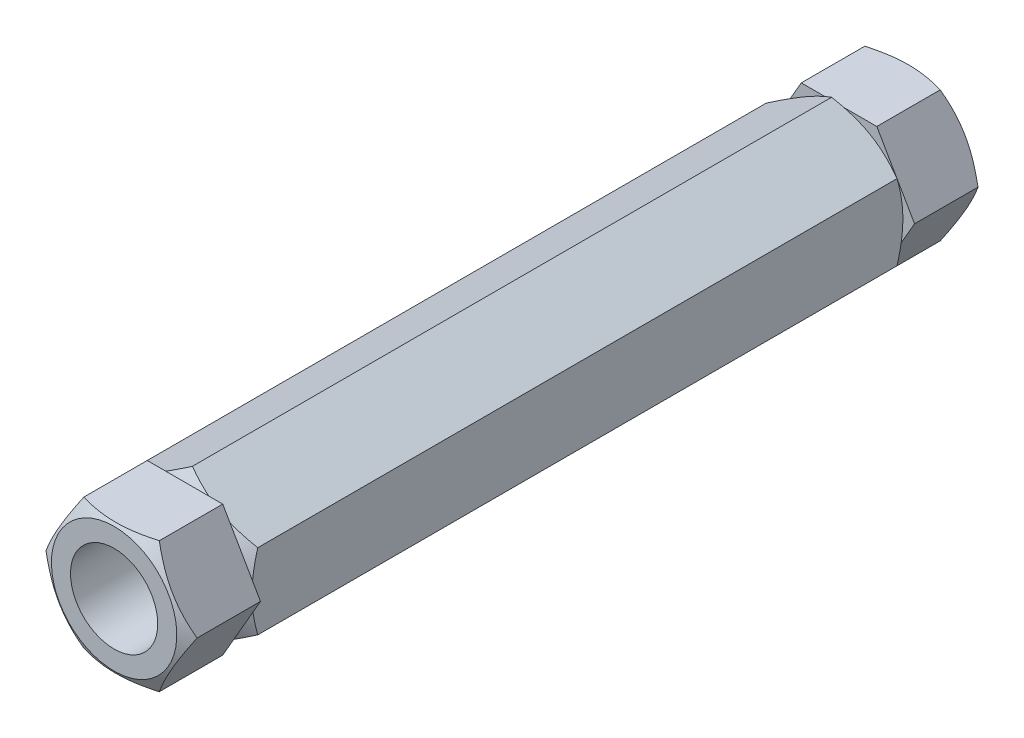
ISO-10303-21;
HEADER;
FILE_DESCRIPTION(('STEP AP214'),'2;1');
FILE_NAME('part.step','',(''),(''),'','','');
FILE_SCHEMA(('AUTOMOTIVE_DESIGN { 1 0 10303 214 1 1 1 1 }'));
ENDSEC;
DATA;
#1=APPLICATION_CONTEXT('core data for automotive mechanical design processes');
#2=APPLICATION_PROTOCOL_DEFINITION('international standard','automotive_design',2000,#1);
#3=PRODUCT_CONTEXT('',#1,'mechanical');
#4=PRODUCT('Part','Part','',(#3));
#5=PRODUCT_RELATED_PRODUCT_CATEGORY('part','',(#4));
#6=PRODUCT_DEFINITION_FORMATION('','',#4);
#7=PRODUCT_DEFINITION_CONTEXT('part definition',#1,'design');
#8=PRODUCT_DEFINITION('design','',#6,#7);
#9=PRODUCT_DEFINITION_SHAPE('','',#8);
#10=(LENGTH_UNIT() NAMED_UNIT(*) SI_UNIT(.MILLI.,.METRE.));
#11=(NAMED_UNIT(*) PLANE_ANGLE_UNIT() SI_UNIT($,.RADIAN.));
#12=(NAMED_UNIT(*) SI_UNIT($,.STERADIAN.) SOLID_ANGLE_UNIT());
#13=UNCERTAINTY_MEASURE_WITH_UNIT(LENGTH_MEASURE(1.E-05),#10,'distance_accuracy_value','');
#14=(GEOMETRIC_REPRESENTATION_CONTEXT(3) GLOBAL_UNCERTAINTY_ASSIGNED_CONTEXT((#13)) GLOBAL_UNIT_ASSIGNED_CONTEXT((#10,
#11,#12)) REPRESENTATION_CONTEXT('',''));
#15=CARTESIAN_POINT('',(0.,0.,0.));
#16=DIRECTION('',(0.,0.,1.));
#17=DIRECTION('',(1.,0.,0.));
#18=AXIS2_PLACEMENT_3D('',#15,#16,#17);
#19=CARTESIAN_POINT('',(6.92820323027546,-12.,146.));
#20=DIRECTION('',(0.,-1.,0.));
#21=DIRECTION('',(0.,0.,1.));
#22=AXIS2_PLACEMENT_3D('',#19,#20,#21);
#23=PLANE('',#22);
#24=DIRECTION('',(-1.,0.,0.));
#25=VECTOR('',#24,1.);
#26=CARTESIAN_POINT('',(6.92820323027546,-12.,133.));
#27=LINE('',#26,#25);
#28=CARTESIAN_POINT('',(6.92820323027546,-12.,133.));
#29=VERTEX_POINT('',#28);
#30=CARTESIAN_POINT('',(-6.92820323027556,-12.,133.));
#31=VERTEX_POINT('',#30);
#32=EDGE_CURVE('E648',#29,#31,#27,.T.);
#33=ORIENTED_EDGE('',*,*,#32,.F.);
#34=DIRECTION('',(0.,0.,-1.));
#35=VECTOR('',#34,1.);
#36=CARTESIAN_POINT('',(6.92820323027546,-12.,146.));
#37=LINE('',#36,#35);
#38=CARTESIAN_POINT('',(6.92820323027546,-12.,144.63952809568));
#39=VERTEX_POINT('',#38);
#40=EDGE_CURVE('E25',#39,#29,#37,.T.);
#41=ORIENTED_EDGE('',*,*,#40,.F.);
#42=CARTESIAN_POINT('',(18.5511120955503,-12.,139.883565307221));
#43=CARTESIAN_POINT('',(18.2893056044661,-12.,140.010478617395));
#44=CARTESIAN_POINT('',(18.0271902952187,-12.,140.136754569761));
#45=CARTESIAN_POINT('',(17.5022775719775,-12.,140.387887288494));
#46=CARTESIAN_POINT('',(17.2394801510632,-12.,140.512744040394));
#47=CARTESIAN_POINT('',(16.4498972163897,-12.,140.885002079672));
#48=CARTESIAN_POINT('',(15.9219993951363,-12.,141.130053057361));
#49=CARTESIAN_POINT('',(14.8597501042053,-12.,141.613726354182));
#50=CARTESIAN_POINT('',(14.3253791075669,-12.,141.852305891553));
#51=CARTESIAN_POINT('',(13.252366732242,-12.,142.31962618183));
#52=CARTESIAN_POINT('',(12.7137255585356,-12.,142.548367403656));
#53=CARTESIAN_POINT('',(11.6141666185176,-12.,143.000456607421));
#54=CARTESIAN_POINT('',(11.0530834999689,-12.,143.223404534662));
#55=CARTESIAN_POINT('',(9.92432726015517,-12.,143.652284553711));
#56=CARTESIAN_POINT('',(9.35665340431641,-12.,143.858214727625));
#57=CARTESIAN_POINT('',(8.21491291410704,-12.,144.247607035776));
#58=CARTESIAN_POINT('',(7.64086209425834,-12.,144.431115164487));
#59=CARTESIAN_POINT('',(6.48447180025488,-12.,144.769746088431));
#60=CARTESIAN_POINT('',(5.90213501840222,-12.,144.924877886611));
#61=CARTESIAN_POINT('',(5.02392332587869,-12.,145.130228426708));
#62=CARTESIAN_POINT('',(4.73119449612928,-12.,145.193985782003));
#63=CARTESIAN_POINT('',(4.14374776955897,-12.,145.311618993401));
#64=CARTESIAN_POINT('',(3.84902991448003,-12.,145.365495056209));
#65=CARTESIAN_POINT('',(3.25781233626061,-12.,145.462411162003));
#66=CARTESIAN_POINT('',(2.96131263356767,-12.,145.505451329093));
#67=CARTESIAN_POINT('',(2.36685078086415,-12.,145.579834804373));
#68=CARTESIAN_POINT('',(2.0688886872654,-12.,145.611178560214));
#69=CARTESIAN_POINT('',(1.47578307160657,-12.,145.661156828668));
#70=CARTESIAN_POINT('',(1.18065306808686,-12.,145.679950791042));
#71=CARTESIAN_POINT('',(0.589863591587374,-12.,145.705045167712));
#72=CARTESIAN_POINT('',(0.294204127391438,-12.,145.711345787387));
#73=CARTESIAN_POINT('',(-0.297117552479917,-12.,145.711303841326));
#74=CARTESIAN_POINT('',(-0.59277976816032,-12.,145.70496118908));
#75=CARTESIAN_POINT('',(-1.18357555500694,-12.,145.679786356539));
#76=CARTESIAN_POINT('',(-1.47870910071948,-12.,145.660953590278));
#77=CARTESIAN_POINT('',(-2.18979135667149,-12.,145.600928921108));
#78=CARTESIAN_POINT('',(-2.60524027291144,-12.,145.553711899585));
#79=CARTESIAN_POINT('',(-3.43301837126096,-12.,145.43711408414));
#80=CARTESIAN_POINT('',(-3.84534711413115,-12.,145.367730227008));
#81=CARTESIAN_POINT('',(-4.66650397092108,-12.,145.209267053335));
#82=CARTESIAN_POINT('',(-5.07532906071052,-12.,145.120172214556));
#83=CARTESIAN_POINT('',(-5.88886052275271,-12.,144.925002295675));
#84=CARTESIAN_POINT('',(-6.29356696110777,-12.,144.818927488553));
#85=CARTESIAN_POINT('',(-7.10774269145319,-12.,144.589873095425));
#86=CARTESIAN_POINT('',(-7.51712127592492,-12.,144.466573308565));
#87=CARTESIAN_POINT('',(-8.33184485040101,-12.,144.207365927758));
#88=CARTESIAN_POINT('',(-8.73718981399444,-12.,144.071458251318));
#89=CARTESIAN_POINT('',(-9.54404896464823,-12.,143.78918152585));
#90=CARTESIAN_POINT('',(-9.94556440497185,-12.,143.642816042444));
#91=CARTESIAN_POINT('',(-10.7452767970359,-12.,143.341332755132));
#92=CARTESIAN_POINT('',(-11.1434737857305,-12.,143.18621504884));
#93=CARTESIAN_POINT('',(-12.0754680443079,-12.,142.81323891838));
#94=CARTESIAN_POINT('',(-12.6080647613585,-12.,142.592385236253));
#95=CARTESIAN_POINT('',(-13.6688002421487,-12.,142.140190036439));
#96=CARTESIAN_POINT('',(-14.1969387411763,-12.,141.908847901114));
#97=CARTESIAN_POINT('',(-15.2495787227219,-12.,141.437755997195));
#98=CARTESIAN_POINT('',(-15.7740794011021,-12.,141.198004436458));
#99=CARTESIAN_POINT('',(-16.8199320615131,-12.,140.711772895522));
#100=CARTESIAN_POINT('',(-17.3412841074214,-12.,140.465293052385));
#101=CARTESIAN_POINT('',(-18.3819084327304,-12.,139.966587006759));
#102=CARTESIAN_POINT('',(-18.9011779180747,-12.,139.714354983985));
#103=CARTESIAN_POINT('',(-19.9374970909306,-12.,139.20537220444));
#104=CARTESIAN_POINT('',(-20.4545467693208,-12.,138.948621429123));
#105=CARTESIAN_POINT('',(-21.4867006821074,-12.,138.431401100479));
#106=CARTESIAN_POINT('',(-22.0018051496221,-12.,138.170932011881));
#107=CARTESIAN_POINT('',(-23.0304116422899,-12.,137.646847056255));
#108=CARTESIAN_POINT('',(-23.5439136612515,-12.,137.383231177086));
#109=CARTESIAN_POINT('',(-24.9976252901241,-12.,136.632193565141));
#110=CARTESIAN_POINT('',(-25.9362166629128,-12.,136.141639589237));
#111=CARTESIAN_POINT('',(-27.8099140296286,-12.,135.153858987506));
#112=CARTESIAN_POINT('',(-28.7450199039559,-12.,134.656632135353));
#113=CARTESIAN_POINT('',(-30.6102319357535,-12.,133.658270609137));
#114=CARTESIAN_POINT('',(-31.5403447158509,-12.,133.157148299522));
#115=CARTESIAN_POINT('',(-32.9338661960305,-12.,132.402484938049));
#116=CARTESIAN_POINT('',(-33.3980865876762,-12.,132.150440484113));
#117=CARTESIAN_POINT('',(-34.326039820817,-12.,131.645457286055));
#118=CARTESIAN_POINT('',(-34.7897726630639,-12.,131.392518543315));
#119=CARTESIAN_POINT('',(-35.2532891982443,-12.,131.139183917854));
#120=B_SPLINE_CURVE_WITH_KNOTS('',3,(#42,#43,#44,#45,#46,#47,#48,#49,#50,#51,#52,#53,#54,#55,
#56,#57,#58,#59,#60,#61,#62,#63,#64,#65,#66,#67,#68,#69,#70,#71,#72,#73,#74,#75,#76,#77,#78,#79,
#80,#81,#82,#83,#84,#85,#86,#87,#88,#89,#90,#91,#92,#93,#94,#95,#96,#97,#98,#99,#100,#101,#102,
#103,#104,#105,#106,#107,#108,#109,#110,#111,#112,#113,#114,#115,#116,#117,#118,#119),
.UNSPECIFIED.,.F.,.F.,(4,2,2,2,2,2,2,2,2,2,2,2,2,2,2,2,2,2,2,2,2,2,2,2,2,2,2,2,2,2,2,2,2,2,2,2,
2,2,4),(0.,0.872836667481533,1.74568222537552,3.49163472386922,5.24719213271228,
7.00266577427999,8.81371989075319,10.6249778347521,12.4324556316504,14.2393589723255,
15.1379941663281,16.03661055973,16.9352166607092,17.8337883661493,18.7207143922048,
19.6076258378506,20.49454335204,21.3815024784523,22.6351779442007,23.8890267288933,
25.1438664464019,26.3986859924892,27.6810742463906,28.9634708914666,30.2454323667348,
31.5273795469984,33.2569446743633,34.986611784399,36.7166497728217,38.4466525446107,
40.1784911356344,41.9103368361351,43.6419679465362,45.3736057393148,48.5507294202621,
51.7279611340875,54.89750618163,56.4821955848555,58.066882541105),.UNSPECIFIED.);
#121=CARTESIAN_POINT('',(-6.92820323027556,-12.,144.63952809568));
#122=VERTEX_POINT('',#121);
#123=EDGE_CURVE('E583',#39,#122,#120,.T.);
#124=ORIENTED_EDGE('',*,*,#123,.T.);
#125=DIRECTION('',(0.,0.,-1.));
#126=VECTOR('',#125,1.);
#127=CARTESIAN_POINT('',(-6.92820323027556,-12.,146.));
#128=LINE('',#127,#126);
#129=EDGE_CURVE('E738',#122,#31,#128,.T.);
#130=ORIENTED_EDGE('',*,*,#129,.T.);
#131=EDGE_LOOP('',(#33,#41,#124,#130));
#132=FACE_BOUND('',#131,.T.);
#133=ADVANCED_FACE('F14',(#132),#23,.T.);
#134=CARTESIAN_POINT('',(6.92820323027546,-12.,146.));
#135=DIRECTION('',(-0.86602540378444,0.5,0.));
#136=DIRECTION('',(-0.5,-0.86602540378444,0.));
#137=AXIS2_PLACEMENT_3D('',#134,#135,#136);
#138=PLANE('',#137);
#139=DIRECTION('',(-0.5,-0.866025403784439,0.));
#140=VECTOR('',#139,1.);
#141=CARTESIAN_POINT('',(13.8564064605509,0.,133.));
#142=LINE('',#141,#140);
#143=CARTESIAN_POINT('',(13.8564064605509,0.,133.));
#144=VERTEX_POINT('',#143);
#145=EDGE_CURVE('E653',#144,#29,#142,.T.);
#146=ORIENTED_EDGE('',*,*,#145,.F.);
#147=DIRECTION('',(0.,0.,-1.));
#148=VECTOR('',#147,1.);
#149=CARTESIAN_POINT('',(13.8564064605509,0.,146.));
#150=LINE('',#149,#148);
#151=CARTESIAN_POINT('',(13.8564064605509,0.,144.63952809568));
#152=VERTEX_POINT('',#151);
#153=EDGE_CURVE('E730',#152,#144,#150,.T.);
#154=ORIENTED_EDGE('',*,*,#153,.F.);
#155=CARTESIAN_POINT('',(6.92808776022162,-12.0002,144.63946142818));
#156=CARTESIAN_POINT('',(7.08038456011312,-11.7364142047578,144.727375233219));
#157=CARTESIAN_POINT('',(7.23324920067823,-11.4716448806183,144.811298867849));
#158=CARTESIAN_POINT('',(7.54020434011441,-10.9399829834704,144.970058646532));
#159=CARTESIAN_POINT('',(7.69429522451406,-10.673089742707,145.044891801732));
#160=CARTESIAN_POINT('',(8.15905073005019,-9.86810959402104,145.254307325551));
#161=CARTESIAN_POINT('',(8.47155003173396,-9.32684492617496,145.373421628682));
#162=CARTESIAN_POINT('',(8.93919090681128,-8.51686717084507,145.513093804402));
#163=CARTESIAN_POINT('',(9.09293539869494,-8.2505738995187,145.552881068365));
#164=CARTESIAN_POINT('',(9.40113622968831,-7.71675440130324,145.619601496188));
#165=CARTESIAN_POINT('',(9.55559258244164,-7.4492281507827,145.646534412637));
#166=CARTESIAN_POINT('',(9.86476279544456,-6.91372963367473,145.686856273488));
#167=CARTESIAN_POINT('',(10.0194761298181,-6.64575827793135,145.700261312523));
#168=CARTESIAN_POINT('',(10.3290461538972,-6.10956726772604,145.713241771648));
#169=CARTESIAN_POINT('',(10.4839028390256,-5.84134762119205,145.712817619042));
#170=CARTESIAN_POINT('',(10.7734076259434,-5.33991062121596,145.699104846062));
#171=CARTESIAN_POINT('',(10.9080763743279,-5.10665750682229,145.687488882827));
#172=CARTESIAN_POINT('',(11.1771041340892,-4.64068775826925,145.654016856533));
#173=CARTESIAN_POINT('',(11.311463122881,-4.40797116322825,145.632160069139));
#174=CARTESIAN_POINT('',(11.5797983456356,-3.94320092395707,145.578587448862));
#175=CARTESIAN_POINT('',(11.7137741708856,-3.71114798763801,145.546863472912));
#176=CARTESIAN_POINT('',(11.9810977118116,-3.24813003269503,145.474113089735));
#177=CARTESIAN_POINT('',(12.1144453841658,-3.01716508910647,145.433086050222));
#178=CARTESIAN_POINT('',(12.5192297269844,-2.31605804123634,145.295013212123));
#179=CARTESIAN_POINT('',(12.7894941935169,-1.84794625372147,145.184199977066));
#180=CARTESIAN_POINT('',(13.3259930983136,-0.918702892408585,144.932699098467));
#181=CARTESIAN_POINT('',(13.592234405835,-0.457559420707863,144.792070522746));
#182=CARTESIAN_POINT('',(13.8565219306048,0.00019999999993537,144.63946142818));
#183=B_SPLINE_CURVE_WITH_KNOTS('',3,(#155,#156,#157,#158,#159,#160,#161,#162,#163,#164,#165,
#166,#167,#168,#169,#170,#171,#172,#173,#174,#175,#176,#177,#178,#179,#180,#181,#182),
.UNSPECIFIED.,.F.,.F.,(4,2,2,2,2,2,2,2,2,2,2,2,2,4),(0.,0.951004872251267,1.90232158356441,
3.80900466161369,4.7389455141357,5.66890426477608,6.59775529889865,7.52657763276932,
8.33514643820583,9.14377244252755,9.95306755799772,10.7624176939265,12.4167102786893,
14.0677556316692),.UNSPECIFIED.);
#184=EDGE_CURVE('E592',#39,#152,#183,.T.);
#185=ORIENTED_EDGE('',*,*,#184,.F.);
#186=ORIENTED_EDGE('',*,*,#40,.T.);
#187=EDGE_LOOP('',(#146,#154,#185,#186));
#188=FACE_BOUND('',#187,.T.);
#189=ADVANCED_FACE('F211',(#188),#138,.F.);
#190=CARTESIAN_POINT('',(6.92820323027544,12.,146.));
#191=DIRECTION('',(0.866025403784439,0.5,0.));
#192=DIRECTION('',(-0.5,0.86602540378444,0.));
#193=AXIS2_PLACEMENT_3D('',#190,#191,#192);
#194=PLANE('',#193);
#195=DIRECTION('',(0.5,-0.866025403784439,0.));
#196=VECTOR('',#195,1.);
#197=CARTESIAN_POINT('',(6.92820323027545,12.,133.));
#198=LINE('',#197,#196);
#199=CARTESIAN_POINT('',(6.92820323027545,12.,133.));
#200=VERTEX_POINT('',#199);
#201=EDGE_CURVE('E656',#200,#144,#198,.T.);
#202=ORIENTED_EDGE('',*,*,#201,.F.);
#203=DIRECTION('',(0.,0.,-1.));
#204=VECTOR('',#203,1.);
#205=CARTESIAN_POINT('',(6.92820323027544,12.,146.));
#206=LINE('',#205,#204);
#207=CARTESIAN_POINT('',(6.92820323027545,12.,144.63952809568));
#208=VERTEX_POINT('',#207);
#209=EDGE_CURVE('E731',#208,#200,#206,.T.);
#210=ORIENTED_EDGE('',*,*,#209,.F.);
#211=CARTESIAN_POINT('',(6.92808776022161,12.0002,144.63946142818));
#212=CARTESIAN_POINT('',(7.08038456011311,11.7364142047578,144.727375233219));
#213=CARTESIAN_POINT('',(7.23324920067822,11.4716448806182,144.811298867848));
#214=CARTESIAN_POINT('',(7.54020434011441,10.9399829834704,144.970058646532));
#215=CARTESIAN_POINT('',(7.69429522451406,10.6730897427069,145.044891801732));
#216=CARTESIAN_POINT('',(8.1590507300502,9.86810959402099,145.254307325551));
#217=CARTESIAN_POINT('',(8.47155003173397,9.32684492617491,145.373421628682));
#218=CARTESIAN_POINT('',(8.9391909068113,8.51686717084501,145.513093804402));
#219=CARTESIAN_POINT('',(9.09293539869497,8.25057389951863,145.552881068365));
#220=CARTESIAN_POINT('',(9.40113622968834,7.71675440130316,145.619601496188));
#221=CARTESIAN_POINT('',(9.55559258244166,7.44922815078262,145.646534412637));
#222=CARTESIAN_POINT('',(9.8647627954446,6.91372963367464,145.686856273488));
#223=CARTESIAN_POINT('',(10.0194761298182,6.64575827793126,145.700261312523));
#224=CARTESIAN_POINT('',(10.3290461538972,6.10956726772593,145.713241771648));
#225=CARTESIAN_POINT('',(10.4839028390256,5.84134762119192,145.712817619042));
#226=CARTESIAN_POINT('',(10.7734076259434,5.33991062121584,145.699104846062));
#227=CARTESIAN_POINT('',(10.9080763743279,5.10665750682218,145.687488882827));
#228=CARTESIAN_POINT('',(11.1771041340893,4.64068775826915,145.654016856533));
#229=CARTESIAN_POINT('',(11.3114631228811,4.40797116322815,145.632160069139));
#230=CARTESIAN_POINT('',(11.5797983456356,3.94320092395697,145.578587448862));
#231=CARTESIAN_POINT('',(11.7137741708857,3.71114798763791,145.546863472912));
#232=CARTESIAN_POINT('',(11.9810977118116,3.24813003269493,145.474113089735));
#233=CARTESIAN_POINT('',(12.1144453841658,3.01716508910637,145.433086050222));
#234=CARTESIAN_POINT('',(12.5192297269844,2.31605804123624,145.295013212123));
#235=CARTESIAN_POINT('',(12.789494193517,1.84794625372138,145.184199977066));
#236=CARTESIAN_POINT('',(13.3259930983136,0.918702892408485,144.932699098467));
#237=CARTESIAN_POINT('',(13.5922344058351,0.457559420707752,144.792070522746));
#238=CARTESIAN_POINT('',(13.8565219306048,-0.000200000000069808,144.63946142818));
#239=B_SPLINE_CURVE_WITH_KNOTS('',3,(#211,#212,#213,#214,#215,#216,#217,#218,#219,#220,#221,
#222,#223,#224,#225,#226,#227,#228,#229,#230,#231,#232,#233,#234,#235,#236,#237,#238),
.UNSPECIFIED.,.F.,.F.,(4,2,2,2,2,2,2,2,2,2,2,2,2,4),(0.,0.951004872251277,1.90232158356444,
3.80900466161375,4.73894551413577,5.66890426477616,6.59775529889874,7.52657763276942,
8.33514643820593,9.14377244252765,9.95306755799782,10.7624176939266,12.4167102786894,
14.0677556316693),.UNSPECIFIED.);
#240=EDGE_CURVE('E623',#208,#152,#239,.T.);
#241=ORIENTED_EDGE('',*,*,#240,.T.);
#242=ORIENTED_EDGE('',*,*,#153,.T.);
#243=EDGE_LOOP('',(#202,#210,#241,#242));
#244=FACE_BOUND('',#243,.T.);
#245=ADVANCED_FACE('F545',(#244),#194,.T.);
#246=CARTESIAN_POINT('',(6.92820323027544,12.,146.));
#247=DIRECTION('',(0.,-1.,0.));
#248=DIRECTION('',(0.,0.,1.));
#249=AXIS2_PLACEMENT_3D('',#246,#247,#248);
#250=PLANE('',#249);
#251=DIRECTION('',(1.,0.,0.));
#252=VECTOR('',#251,1.);
#253=CARTESIAN_POINT('',(-6.92820323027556,12.,133.));
#254=LINE('',#253,#252);
#255=CARTESIAN_POINT('',(-6.92820323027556,12.,133.));
#256=VERTEX_POINT('',#255);
#257=EDGE_CURVE('E659',#256,#200,#254,.T.);
#258=ORIENTED_EDGE('',*,*,#257,.F.);
#259=DIRECTION('',(0.,0.,-1.));
#260=VECTOR('',#259,1.);
#261=CARTESIAN_POINT('',(-6.92820323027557,12.,146.));
#262=LINE('',#261,#260);
#263=CARTESIAN_POINT('',(-6.92820323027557,12.,144.63952809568));
#264=VERTEX_POINT('',#263);
#265=EDGE_CURVE('E712',#264,#256,#262,.T.);
#266=ORIENTED_EDGE('',*,*,#265,.F.);
#267=CARTESIAN_POINT('',(18.5511120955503,12.,139.883565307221));
#268=CARTESIAN_POINT('',(18.2893056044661,12.,140.010478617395));
#269=CARTESIAN_POINT('',(18.0271902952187,12.,140.136754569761));
#270=CARTESIAN_POINT('',(17.5022775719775,12.,140.387887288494));
#271=CARTESIAN_POINT('',(17.2394801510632,12.,140.512744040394));
#272=CARTESIAN_POINT('',(16.4498972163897,12.,140.885002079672));
#273=CARTESIAN_POINT('',(15.9219993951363,12.,141.130053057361));
#274=CARTESIAN_POINT('',(14.8597501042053,12.,141.613726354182));
#275=CARTESIAN_POINT('',(14.3253791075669,12.,141.852305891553));
#276=CARTESIAN_POINT('',(13.252366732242,12.,142.31962618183));
#277=CARTESIAN_POINT('',(12.7137255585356,12.,142.548367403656));
#278=CARTESIAN_POINT('',(11.6141666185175,12.,143.000456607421));
#279=CARTESIAN_POINT('',(11.0530834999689,12.,143.223404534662));
#280=CARTESIAN_POINT('',(9.92432726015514,12.,143.652284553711));
#281=CARTESIAN_POINT('',(9.35665340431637,12.,143.858214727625));
#282=CARTESIAN_POINT('',(8.214912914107,12.,144.247607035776));
#283=CARTESIAN_POINT('',(7.6408620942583,12.,144.431115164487));
#284=CARTESIAN_POINT('',(6.48447180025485,12.,144.769746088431));
#285=CARTESIAN_POINT('',(5.90213501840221,12.,144.924877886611));
#286=CARTESIAN_POINT('',(5.02392332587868,12.,145.130228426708));
#287=CARTESIAN_POINT('',(4.73119449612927,12.,145.193985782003));
#288=CARTESIAN_POINT('',(4.14374776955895,12.,145.3116189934));
#289=CARTESIAN_POINT('',(3.84902991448,12.,145.365495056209));
#290=CARTESIAN_POINT('',(3.25781233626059,12.,145.462411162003));
#291=CARTESIAN_POINT('',(2.96131263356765,12.,145.505451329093));
#292=CARTESIAN_POINT('',(2.36685078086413,12.,145.579834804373));
#293=CARTESIAN_POINT('',(2.06888868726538,12.,145.611178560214));
#294=CARTESIAN_POINT('',(1.47578307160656,12.,145.661156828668));
#295=CARTESIAN_POINT('',(1.18065306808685,12.,145.679950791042));
#296=CARTESIAN_POINT('',(0.589863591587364,12.,145.705045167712));
#297=CARTESIAN_POINT('',(0.294204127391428,12.,145.711345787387));
#298=CARTESIAN_POINT('',(-0.297117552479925,12.,145.711303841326));
#299=CARTESIAN_POINT('',(-0.592779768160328,12.,145.704961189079));
#300=CARTESIAN_POINT('',(-1.18357555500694,12.,145.679786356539));
#301=CARTESIAN_POINT('',(-1.47870910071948,12.,145.660953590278));
#302=CARTESIAN_POINT('',(-2.18979135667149,12.,145.600928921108));
#303=CARTESIAN_POINT('',(-2.60524027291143,12.,145.553711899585));
#304=CARTESIAN_POINT('',(-3.43301837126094,12.,145.43711408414));
#305=CARTESIAN_POINT('',(-3.84534711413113,12.,145.367730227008));
#306=CARTESIAN_POINT('',(-4.66650397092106,12.,145.209267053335));
#307=CARTESIAN_POINT('',(-5.07532906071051,12.,145.120172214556));
#308=CARTESIAN_POINT('',(-5.88886052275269,12.,144.925002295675));
#309=CARTESIAN_POINT('',(-6.29356696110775,12.,144.818927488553));
#310=CARTESIAN_POINT('',(-7.10774269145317,12.,144.589873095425));
#311=CARTESIAN_POINT('',(-7.51712127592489,12.,144.466573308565));
#312=CARTESIAN_POINT('',(-8.33184485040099,12.,144.207365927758));
#313=CARTESIAN_POINT('',(-8.73718981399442,12.,144.071458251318));
#314=CARTESIAN_POINT('',(-9.54404896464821,12.,143.78918152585));
#315=CARTESIAN_POINT('',(-9.94556440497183,12.,143.642816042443));
#316=CARTESIAN_POINT('',(-10.7452767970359,12.,143.341332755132));
#317=CARTESIAN_POINT('',(-11.1434737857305,12.,143.18621504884));
#318=CARTESIAN_POINT('',(-12.0754680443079,12.,142.81323891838));
#319=CARTESIAN_POINT('',(-12.6080647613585,12.,142.592385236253));
#320=CARTESIAN_POINT('',(-13.6688002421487,12.,142.140190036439));
#321=CARTESIAN_POINT('',(-14.1969387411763,12.,141.908847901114));
#322=CARTESIAN_POINT('',(-15.2495787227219,12.,141.437755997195));
#323=CARTESIAN_POINT('',(-15.7740794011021,12.,141.198004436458));
#324=CARTESIAN_POINT('',(-16.8199320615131,12.,140.711772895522));
#325=CARTESIAN_POINT('',(-17.3412841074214,12.,140.465293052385));
#326=CARTESIAN_POINT('',(-18.3819084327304,12.,139.966587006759));
#327=CARTESIAN_POINT('',(-18.9011779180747,12.,139.714354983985));
#328=CARTESIAN_POINT('',(-19.9374970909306,12.,139.20537220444));
#329=CARTESIAN_POINT('',(-20.4545467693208,12.,138.948621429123));
#330=CARTESIAN_POINT('',(-21.4867006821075,12.,138.431401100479));
#331=CARTESIAN_POINT('',(-22.0018051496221,12.,138.170932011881));
#332=CARTESIAN_POINT('',(-23.0304116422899,12.,137.646847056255));
#333=CARTESIAN_POINT('',(-23.5439136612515,12.,137.383231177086));
#334=CARTESIAN_POINT('',(-24.9976252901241,12.,136.632193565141));
#335=CARTESIAN_POINT('',(-25.9362166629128,12.,136.141639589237));
#336=CARTESIAN_POINT('',(-27.8099140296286,12.,135.153858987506));
#337=CARTESIAN_POINT('',(-28.745019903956,12.,134.656632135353));
#338=CARTESIAN_POINT('',(-30.6102319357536,12.,133.658270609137));
#339=CARTESIAN_POINT('',(-31.5403447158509,12.,133.157148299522));
#340=CARTESIAN_POINT('',(-32.9338661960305,12.,132.402484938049));
#341=CARTESIAN_POINT('',(-33.3980865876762,12.,132.150440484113));
#342=CARTESIAN_POINT('',(-34.3260398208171,12.,131.645457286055));
#343=CARTESIAN_POINT('',(-34.789772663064,12.,131.392518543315));
#344=CARTESIAN_POINT('',(-35.2532891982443,12.,131.139183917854));
#345=B_SPLINE_CURVE_WITH_KNOTS('',3,(#267,#268,#269,#270,#271,#272,#273,#274,#275,#276,#277,
#278,#279,#280,#281,#282,#283,#284,#285,#286,#287,#288,#289,#290,#291,#292,#293,#294,#295,#296,
#297,#298,#299,#300,#301,#302,#303,#304,#305,#306,#307,#308,#309,#310,#311,#312,#313,#314,#315,
#316,#317,#318,#319,#320,#321,#322,#323,#324,#325,#326,#327,#328,#329,#330,#331,#332,#333,#334,
#335,#336,#337,#338,#339,#340,#341,#342,#343,#344),.UNSPECIFIED.,.F.,.F.,(4,2,2,2,2,2,2,2,2,2,2,
2,2,2,2,2,2,2,2,2,2,2,2,2,2,2,2,2,2,2,2,2,2,2,2,2,2,2,4),(0.,0.872836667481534,1.7456822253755,
3.49163472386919,5.24719213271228,7.00266577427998,8.81371989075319,10.6249778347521,
12.4324556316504,14.2393589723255,15.1379941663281,16.03661055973,16.9352166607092,
17.8337883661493,18.7207143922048,19.6076258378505,20.49454335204,21.3815024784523,
22.6351779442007,23.8890267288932,25.1438664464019,26.3986859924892,27.6810742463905,
28.9634708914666,30.2454323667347,31.5273795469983,33.2569446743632,34.9866117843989,
36.7166497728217,38.4466525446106,40.1784911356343,41.9103368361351,43.6419679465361,
45.3736057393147,48.5507294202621,51.7279611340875,54.89750618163,56.4821955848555,
58.066882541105),.UNSPECIFIED.);
#346=EDGE_CURVE('E618',#208,#264,#345,.T.);
#347=ORIENTED_EDGE('',*,*,#346,.F.);
#348=ORIENTED_EDGE('',*,*,#209,.T.);
#349=EDGE_LOOP('',(#258,#266,#347,#348));
#350=FACE_BOUND('',#349,.T.);
#351=ADVANCED_FACE('F535',(#350),#250,.F.);
#352=CARTESIAN_POINT('',(-6.92820323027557,12.,146.));
#353=DIRECTION('',(0.86602540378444,-0.5,0.));
#354=DIRECTION('',(0.5,0.86602540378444,0.));
#355=AXIS2_PLACEMENT_3D('',#352,#353,#354);
#356=PLANE('',#355);
#357=DIRECTION('',(0.5,0.866025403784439,0.));
#358=VECTOR('',#357,1.);
#359=CARTESIAN_POINT('',(-13.856406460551,0.,133.));
#360=LINE('',#359,#358);
#361=CARTESIAN_POINT('',(-13.856406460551,0.,133.));
#362=VERTEX_POINT('',#361);
#363=EDGE_CURVE('E662',#362,#256,#360,.T.);
#364=ORIENTED_EDGE('',*,*,#363,.F.);
#365=DIRECTION('',(0.,0.,-1.));
#366=VECTOR('',#365,1.);
#367=CARTESIAN_POINT('',(-13.856406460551,0.,146.));
#368=LINE('',#367,#366);
#369=CARTESIAN_POINT('',(-13.856406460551,0.,144.63952809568));
#370=VERTEX_POINT('',#369);
#371=EDGE_CURVE('E710',#370,#362,#368,.T.);
#372=ORIENTED_EDGE('',*,*,#371,.F.);
#373=CARTESIAN_POINT('',(-6.92808776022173,12.0002,144.63946142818));
#374=CARTESIAN_POINT('',(-7.08038456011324,11.7364142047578,144.727375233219));
#375=CARTESIAN_POINT('',(-7.23324920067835,11.4716448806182,144.811298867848));
#376=CARTESIAN_POINT('',(-7.54020434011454,10.9399829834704,144.970058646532));
#377=CARTESIAN_POINT('',(-7.69429522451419,10.6730897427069,145.044891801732));
#378=CARTESIAN_POINT('',(-8.15905073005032,9.86810959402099,145.254307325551));
#379=CARTESIAN_POINT('',(-8.4715500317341,9.3268449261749,145.373421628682));
#380=CARTESIAN_POINT('',(-8.93919090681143,8.51686717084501,145.513093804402));
#381=CARTESIAN_POINT('',(-9.0929353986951,8.25057389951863,145.552881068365));
#382=CARTESIAN_POINT('',(-9.40113622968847,7.71675440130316,145.619601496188));
#383=CARTESIAN_POINT('',(-9.55559258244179,7.44922815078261,145.646534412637));
#384=CARTESIAN_POINT('',(-9.86476279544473,6.91372963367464,145.686856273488));
#385=CARTESIAN_POINT('',(-10.0194761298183,6.64575827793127,145.700261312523));
#386=CARTESIAN_POINT('',(-10.3290461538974,6.10956726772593,145.713241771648));
#387=CARTESIAN_POINT('',(-10.4839028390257,5.84134762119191,145.712817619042));
#388=CARTESIAN_POINT('',(-10.7734076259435,5.33991062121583,145.699104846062));
#389=CARTESIAN_POINT('',(-10.9080763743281,5.10665750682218,145.687488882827));
#390=CARTESIAN_POINT('',(-11.1771041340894,4.64068775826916,145.654016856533));
#391=CARTESIAN_POINT('',(-11.3114631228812,4.40797116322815,145.632160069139));
#392=CARTESIAN_POINT('',(-11.5797983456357,3.94320092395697,145.578587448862));
#393=CARTESIAN_POINT('',(-11.7137741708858,3.71114798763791,145.546863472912));
#394=CARTESIAN_POINT('',(-11.9810977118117,3.24813003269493,145.474113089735));
#395=CARTESIAN_POINT('',(-12.114445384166,3.01716508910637,145.433086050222));
#396=CARTESIAN_POINT('',(-12.5192297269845,2.31605804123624,145.295013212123));
#397=CARTESIAN_POINT('',(-12.7894941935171,1.84794625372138,145.184199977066));
#398=CARTESIAN_POINT('',(-13.3259930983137,0.918702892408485,144.932699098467));
#399=CARTESIAN_POINT('',(-13.5922344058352,0.457559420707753,144.792070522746));
#400=CARTESIAN_POINT('',(-13.8565219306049,-0.000200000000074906,144.63946142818));
#401=B_SPLINE_CURVE_WITH_KNOTS('',3,(#373,#374,#375,#376,#377,#378,#379,#380,#381,#382,#383,
#384,#385,#386,#387,#388,#389,#390,#391,#392,#393,#394,#395,#396,#397,#398,#399,#400),
.UNSPECIFIED.,.F.,.F.,(4,2,2,2,2,2,2,2,2,2,2,2,2,4),(0.,0.951004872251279,1.90232158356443,
3.80900466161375,4.73894551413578,5.66890426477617,6.59775529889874,7.52657763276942,
8.33514643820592,9.14377244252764,9.95306755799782,10.7624176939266,12.4167102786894,
14.0677556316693),.UNSPECIFIED.);
#402=EDGE_CURVE('E34',#264,#370,#401,.T.);
#403=ORIENTED_EDGE('',*,*,#402,.F.);
#404=ORIENTED_EDGE('',*,*,#265,.T.);
#405=EDGE_LOOP('',(#364,#372,#403,#404));
#406=FACE_BOUND('',#405,.T.);
#407=ADVANCED_FACE('F523',(#406),#356,.F.);
#408=CARTESIAN_POINT('',(-6.92820323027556,-12.,146.));
#409=DIRECTION('',(-0.86602540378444,-0.5,0.));
#410=DIRECTION('',(0.5,-0.86602540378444,0.));
#411=AXIS2_PLACEMENT_3D('',#408,#409,#410);
#412=PLANE('',#411);
#413=DIRECTION('',(-0.5,0.866025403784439,0.));
#414=VECTOR('',#413,1.);
#415=CARTESIAN_POINT('',(-6.92820323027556,-12.,133.));
#416=LINE('',#415,#414);
#417=EDGE_CURVE('E644',#31,#362,#416,.T.);
#418=ORIENTED_EDGE('',*,*,#417,.F.);
#419=ORIENTED_EDGE('',*,*,#129,.F.);
#420=CARTESIAN_POINT('',(-6.92808776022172,-12.0002,144.63946142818));
#421=CARTESIAN_POINT('',(-7.08038456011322,-11.7364142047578,144.727375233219));
#422=CARTESIAN_POINT('',(-7.23324920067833,-11.4716448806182,144.811298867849));
#423=CARTESIAN_POINT('',(-7.54020434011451,-10.9399829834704,144.970058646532));
#424=CARTESIAN_POINT('',(-7.69429522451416,-10.673089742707,145.044891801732));
#425=CARTESIAN_POINT('',(-8.1590507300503,-9.86810959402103,145.254307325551));
#426=CARTESIAN_POINT('',(-8.47155003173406,-9.32684492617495,145.373421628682));
#427=CARTESIAN_POINT('',(-8.93919090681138,-8.51686717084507,145.513093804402));
#428=CARTESIAN_POINT('',(-9.09293539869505,-8.2505738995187,145.552881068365));
#429=CARTESIAN_POINT('',(-9.40113622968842,-7.71675440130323,145.619601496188));
#430=CARTESIAN_POINT('',(-9.55559258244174,-7.4492281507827,145.646534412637));
#431=CARTESIAN_POINT('',(-9.86476279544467,-6.91372963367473,145.686856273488));
#432=CARTESIAN_POINT('',(-10.0194761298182,-6.64575827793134,145.700261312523));
#433=CARTESIAN_POINT('',(-10.3290461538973,-6.10956726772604,145.713241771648));
#434=CARTESIAN_POINT('',(-10.4839028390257,-5.84134762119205,145.712817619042));
#435=CARTESIAN_POINT('',(-10.7734076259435,-5.33991062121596,145.699104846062));
#436=CARTESIAN_POINT('',(-10.908076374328,-5.10665750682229,145.687488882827));
#437=CARTESIAN_POINT('',(-11.1771041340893,-4.64068775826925,145.654016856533));
#438=CARTESIAN_POINT('',(-11.3114631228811,-4.40797116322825,145.632160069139));
#439=CARTESIAN_POINT('',(-11.5797983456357,-3.94320092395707,145.578587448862));
#440=CARTESIAN_POINT('',(-11.7137741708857,-3.71114798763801,145.546863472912));
#441=CARTESIAN_POINT('',(-11.9810977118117,-3.24813003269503,145.474113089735));
#442=CARTESIAN_POINT('',(-12.1144453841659,-3.01716508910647,145.433086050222));
#443=CARTESIAN_POINT('',(-12.5192297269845,-2.31605804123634,145.295013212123));
#444=CARTESIAN_POINT('',(-12.789494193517,-1.84794625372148,145.184199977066));
#445=CARTESIAN_POINT('',(-13.3259930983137,-0.918702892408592,144.932699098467));
#446=CARTESIAN_POINT('',(-13.5922344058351,-0.457559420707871,144.792070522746));
#447=CARTESIAN_POINT('',(-13.8565219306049,0.000199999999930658,144.63946142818));
#448=B_SPLINE_CURVE_WITH_KNOTS('',3,(#420,#421,#422,#423,#424,#425,#426,#427,#428,#429,#430,
#431,#432,#433,#434,#435,#436,#437,#438,#439,#440,#441,#442,#443,#444,#445,#446,#447),
.UNSPECIFIED.,.F.,.F.,(4,2,2,2,2,2,2,2,2,2,2,2,2,4),(0.,0.951004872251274,1.90232158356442,
3.80900466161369,4.7389455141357,5.66890426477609,6.59775529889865,7.52657763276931,
8.33514643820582,9.14377244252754,9.95306755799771,10.7624176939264,12.4167102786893,
14.0677556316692),.UNSPECIFIED.);
#449=EDGE_CURVE('E603',#122,#370,#448,.T.);
#450=ORIENTED_EDGE('',*,*,#449,.T.);
#451=ORIENTED_EDGE('',*,*,#371,.T.);
#452=EDGE_LOOP('',(#418,#419,#450,#451));
#453=FACE_BOUND('',#452,.T.);
#454=ADVANCED_FACE('F517',(#453),#412,.T.);
#455=CARTESIAN_POINT('',(-6.92820323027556,-12.,146.));
#456=DIRECTION('',(0.,0.,1.));
#457=DIRECTION('',(0.,1.,0.));
#458=AXIS2_PLACEMENT_3D('',#455,#456,#457);
#459=PLANE('',#458);
#460=CARTESIAN_POINT('',(0.,0.,146.));
#461=DIRECTION('',(0.,0.,1.));
#462=DIRECTION('',(0.,1.,0.));
#463=AXIS2_PLACEMENT_3D('',#460,#461,#462);
#464=CIRCLE('',#463,8.);
#465=CARTESIAN_POINT('',(0.,7.99999999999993,146.));
#466=VERTEX_POINT('',#465);
#467=EDGE_CURVE('E591',#466,#466,#464,.T.);
#468=ORIENTED_EDGE('',*,*,#467,.F.);
#469=EDGE_LOOP('',(#468));
#470=FACE_BOUND('',#469,.T.);
#471=CARTESIAN_POINT('',(0.,0.,146.));
#472=DIRECTION('',(0.,0.,1.));
#473=DIRECTION('',(0.,1.,0.));
#474=AXIS2_PLACEMENT_3D('',#471,#472,#473);
#475=CIRCLE('',#474,11.5);
#476=CARTESIAN_POINT('',(0.,11.4999999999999,146.));
#477=VERTEX_POINT('',#476);
#478=EDGE_CURVE('E639',#477,#477,#475,.T.);
#479=ORIENTED_EDGE('',*,*,#478,.T.);
#480=EDGE_LOOP('',(#479));
#481=FACE_BOUND('',#480,.T.);
#482=ADVANCED_FACE('F522',(#470,#481),#459,.T.);
#483=CARTESIAN_POINT('',(-6.92820323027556,-12.,133.));
#484=DIRECTION('',(0.,0.,-1.));
#485=DIRECTION('',(1.,0.,0.));
#486=AXIS2_PLACEMENT_3D('',#483,#484,#485);
#487=PLANE('',#486);
#488=CARTESIAN_POINT('',(0.,0.,133.));
#489=DIRECTION('',(0.,0.,-1.));
#490=DIRECTION('',(-1.,0.,0.));
#491=AXIS2_PLACEMENT_3D('',#488,#489,#490);
#492=CIRCLE('',#491,11.5);
#493=CARTESIAN_POINT('',(-11.5,0.,133.));
#494=VERTEX_POINT('',#493);
#495=EDGE_CURVE('E9',#494,#494,#492,.T.);
#496=ORIENTED_EDGE('',*,*,#495,.F.);
#497=EDGE_LOOP('',(#496));
#498=FACE_BOUND('',#497,.T.);
#499=ORIENTED_EDGE('',*,*,#363,.T.);
#500=ORIENTED_EDGE('',*,*,#257,.T.);
#501=ORIENTED_EDGE('',*,*,#201,.T.);
#502=ORIENTED_EDGE('',*,*,#145,.T.);
#503=ORIENTED_EDGE('',*,*,#32,.T.);
#504=ORIENTED_EDGE('',*,*,#417,.T.);
#505=EDGE_LOOP('',(#499,#500,#501,#502,#503,#504));
#506=FACE_BOUND('',#505,.T.);
#507=ADVANCED_FACE('F498',(#498,#506),#487,.T.);
#508=CARTESIAN_POINT('',(0.,0.,146.));
#509=DIRECTION('',(0.,0.,-1.));
#510=DIRECTION('',(1.,0.,0.));
#511=AXIS2_PLACEMENT_3D('',#508,#509,#510);
#512=CYLINDRICAL_SURFACE('',#511,8.);
#513=ORIENTED_EDGE('',*,*,#467,.T.);
#514=EDGE_LOOP('',(#513));
#515=FACE_BOUND('',#514,.T.);
#516=CARTESIAN_POINT('',(0.,0.,0.));
#517=DIRECTION('',(0.,0.,-1.));
#518=DIRECTION('',(0.,-1.,0.));
#519=AXIS2_PLACEMENT_3D('',#516,#517,#518);
#520=CIRCLE('',#519,8.);
#521=CARTESIAN_POINT('',(0.,-8.,0.));
#522=VERTEX_POINT('',#521);
#523=EDGE_CURVE('E681',#522,#522,#520,.T.);
#524=ORIENTED_EDGE('',*,*,#523,.T.);
#525=EDGE_LOOP('',(#524));
#526=FACE_BOUND('',#525,.T.);
#527=ADVANCED_FACE('F489',(#515,#526),#512,.F.);
#528=CARTESIAN_POINT('',(0.,0.,146.));
#529=DIRECTION('',(0.,0.,-1.));
#530=DIRECTION('',(0.,-1.,0.));
#531=AXIS2_PLACEMENT_3D('',#528,#529,#530);
#532=CONICAL_SURFACE('',#531,11.5,1.0471975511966);
#533=ORIENTED_EDGE('',*,*,#184,.T.);
#534=ORIENTED_EDGE('',*,*,#240,.F.);
#535=ORIENTED_EDGE('',*,*,#346,.T.);
#536=ORIENTED_EDGE('',*,*,#402,.T.);
#537=ORIENTED_EDGE('',*,*,#449,.F.);
#538=ORIENTED_EDGE('',*,*,#123,.F.);
#539=EDGE_LOOP('',(#533,#534,#535,#536,#537,#538));
#540=FACE_BOUND('',#539,.T.);
#541=ORIENTED_EDGE('',*,*,#478,.F.);
#542=EDGE_LOOP('',(#541));
#543=FACE_BOUND('',#542,.T.);
#544=ADVANCED_FACE('F480',(#540,#543),#532,.T.);
#545=CARTESIAN_POINT('',(6.92820323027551,12.,0.));
#546=DIRECTION('',(0.,1.,0.));
#547=DIRECTION('',(0.,0.,-1.));
#548=AXIS2_PLACEMENT_3D('',#545,#546,#547);
#549=PLANE('',#548);
#550=DIRECTION('',(-1.,0.,0.));
#551=VECTOR('',#550,1.);
#552=CARTESIAN_POINT('',(6.9282032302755,12.,13.));
#553=LINE('',#552,#551);
#554=CARTESIAN_POINT('',(6.9282032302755,12.,13.));
#555=VERTEX_POINT('',#554);
#556=CARTESIAN_POINT('',(-6.92820323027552,12.,13.));
#557=VERTEX_POINT('',#556);
#558=EDGE_CURVE('E175',#555,#557,#553,.T.);
#559=ORIENTED_EDGE('',*,*,#558,.F.);
#560=DIRECTION('',(0.,0.,1.));
#561=VECTOR('',#560,1.);
#562=CARTESIAN_POINT('',(6.92820323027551,12.,0.));
#563=LINE('',#562,#561);
#564=CARTESIAN_POINT('',(6.9282032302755,12.,1.3604719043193));
#565=VERTEX_POINT('',#564);
#566=EDGE_CURVE('E667',#565,#555,#563,.T.);
#567=ORIENTED_EDGE('',*,*,#566,.F.);
#568=CARTESIAN_POINT('',(18.5511120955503,12.,6.11643469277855));
#569=CARTESIAN_POINT('',(18.2893056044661,12.,5.989521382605));
#570=CARTESIAN_POINT('',(18.0271902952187,12.,5.86324543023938));
#571=CARTESIAN_POINT('',(17.5022775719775,12.,5.6121127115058));
#572=CARTESIAN_POINT('',(17.2394801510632,12.,5.48725595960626));
#573=CARTESIAN_POINT('',(16.4498972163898,12.,5.11499792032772));
#574=CARTESIAN_POINT('',(15.9219993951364,12.,4.86994694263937));
#575=CARTESIAN_POINT('',(14.8597501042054,12.,4.38627364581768));
#576=CARTESIAN_POINT('',(14.325379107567,12.,4.1476941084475));
#577=CARTESIAN_POINT('',(13.2523667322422,12.,3.68037381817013));
#578=CARTESIAN_POINT('',(12.7137255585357,12.,3.45163259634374));
#579=CARTESIAN_POINT('',(11.6141666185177,12.,2.99954339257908));
#580=CARTESIAN_POINT('',(11.053083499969,12.,2.77659546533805));
#581=CARTESIAN_POINT('',(9.92432726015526,12.,2.3477154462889));
#582=CARTESIAN_POINT('',(9.35665340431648,12.,2.14178527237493));
#583=CARTESIAN_POINT('',(8.21491291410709,12.,1.7523929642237));
#584=CARTESIAN_POINT('',(7.64086209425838,12.,1.56888483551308));
#585=CARTESIAN_POINT('',(6.48447180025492,12.,1.23025391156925));
#586=CARTESIAN_POINT('',(5.90213501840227,12.,1.07512211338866));
#587=CARTESIAN_POINT('',(5.02392332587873,12.,0.869771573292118));
#588=CARTESIAN_POINT('',(4.73119449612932,12.,0.806014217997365));
#589=CARTESIAN_POINT('',(4.143747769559,12.,0.688381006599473));
#590=CARTESIAN_POINT('',(3.84902991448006,12.,0.634504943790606));
#591=CARTESIAN_POINT('',(3.25781233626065,12.,0.537588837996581));
#592=CARTESIAN_POINT('',(2.9613126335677,12.,0.494548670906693));
#593=CARTESIAN_POINT('',(2.36685078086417,12.,0.420165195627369));
#594=CARTESIAN_POINT('',(2.06888868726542,12.,0.388821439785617));
#595=CARTESIAN_POINT('',(1.4757830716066,12.,0.338843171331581));
#596=CARTESIAN_POINT('',(1.18065306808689,12.,0.320049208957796));
#597=CARTESIAN_POINT('',(0.589863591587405,12.,0.294954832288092));
#598=CARTESIAN_POINT('',(0.294204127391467,12.,0.288654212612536));
#599=CARTESIAN_POINT('',(-0.297117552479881,12.,0.288696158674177));
#600=CARTESIAN_POINT('',(-0.592779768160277,12.,0.295038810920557));
#601=CARTESIAN_POINT('',(-1.18357555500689,12.,0.320213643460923));
#602=CARTESIAN_POINT('',(-1.47870910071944,12.,0.339046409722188));
#603=CARTESIAN_POINT('',(-2.18979135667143,12.,0.399071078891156));
#604=CARTESIAN_POINT('',(-2.60524027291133,12.,0.446288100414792));
#605=CARTESIAN_POINT('',(-3.43301837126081,12.,0.562885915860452));
#606=CARTESIAN_POINT('',(-3.84534711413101,12.,0.632269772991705));
#607=CARTESIAN_POINT('',(-4.66650397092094,12.,0.790732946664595));
#608=CARTESIAN_POINT('',(-5.07532906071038,12.,0.879827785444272));
#609=CARTESIAN_POINT('',(-5.88886052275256,12.,1.07499770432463));
#610=CARTESIAN_POINT('',(-6.29356696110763,12.,1.18107251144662));
#611=CARTESIAN_POINT('',(-7.10774269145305,12.,1.41012690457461));
#612=CARTESIAN_POINT('',(-7.51712127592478,12.,1.53342669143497));
#613=CARTESIAN_POINT('',(-8.33184485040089,12.,1.79263407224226));
#614=CARTESIAN_POINT('',(-8.73718981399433,12.,1.92854174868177));
#615=CARTESIAN_POINT('',(-9.54404896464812,12.,2.21081847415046));
#616=CARTESIAN_POINT('',(-9.94556440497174,12.,2.35718395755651));
#617=CARTESIAN_POINT('',(-10.7452767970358,12.,2.65866724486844));
#618=CARTESIAN_POINT('',(-11.1434737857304,12.,2.81378495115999));
#619=CARTESIAN_POINT('',(-12.0754680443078,12.,3.18676108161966));
#620=CARTESIAN_POINT('',(-12.6080647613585,12.,3.40761476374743));
#621=CARTESIAN_POINT('',(-13.6688002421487,12.,3.85980996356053));
#622=CARTESIAN_POINT('',(-14.1969387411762,12.,4.09115209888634));
#623=CARTESIAN_POINT('',(-15.2495787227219,12.,4.56224400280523));
#624=CARTESIAN_POINT('',(-15.7740794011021,12.,4.80199556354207));
#625=CARTESIAN_POINT('',(-16.8199320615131,12.,5.28822710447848));
#626=CARTESIAN_POINT('',(-17.3412841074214,12.,5.53470694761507));
#627=CARTESIAN_POINT('',(-18.3819084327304,12.,6.03341299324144));
#628=CARTESIAN_POINT('',(-18.9011779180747,12.,6.28564501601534));
#629=CARTESIAN_POINT('',(-19.9374970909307,12.,6.79462779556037));
#630=CARTESIAN_POINT('',(-20.4545467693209,12.,7.05137857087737));
#631=CARTESIAN_POINT('',(-21.4867006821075,12.,7.56859889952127));
#632=CARTESIAN_POINT('',(-22.0018051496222,12.,7.82906798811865));
#633=CARTESIAN_POINT('',(-23.03041164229,12.,8.35315294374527));
#634=CARTESIAN_POINT('',(-23.5439136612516,12.,8.61676882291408));
#635=CARTESIAN_POINT('',(-24.9976252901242,12.,9.36780643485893));
#636=CARTESIAN_POINT('',(-25.9362166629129,12.,9.85836041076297));
#637=CARTESIAN_POINT('',(-27.8099140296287,12.,10.8461410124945));
#638=CARTESIAN_POINT('',(-28.745019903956,12.,11.3433678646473));
#639=CARTESIAN_POINT('',(-30.6102319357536,12.,12.3417293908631));
#640=CARTESIAN_POINT('',(-31.5403447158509,12.,12.8428517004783));
#641=CARTESIAN_POINT('',(-32.9338661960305,12.,13.5975150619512));
#642=CARTESIAN_POINT('',(-33.3980865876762,12.,13.8495595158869));
#643=CARTESIAN_POINT('',(-34.326039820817,12.,14.3545427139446));
#644=CARTESIAN_POINT('',(-34.7897726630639,12.,14.607481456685));
#645=CARTESIAN_POINT('',(-35.2532891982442,12.,14.860816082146));
#646=B_SPLINE_CURVE_WITH_KNOTS('',3,(#568,#569,#570,#571,#572,#573,#574,#575,#576,#577,#578,
#579,#580,#581,#582,#583,#584,#585,#586,#587,#588,#589,#590,#591,#592,#593,#594,#595,#596,#597,
#598,#599,#600,#601,#602,#603,#604,#605,#606,#607,#608,#609,#610,#611,#612,#613,#614,#615,#616,
#617,#618,#619,#620,#621,#622,#623,#624,#625,#626,#627,#628,#629,#630,#631,#632,#633,#634,#635,
#636,#637,#638,#639,#640,#641,#642,#643,#644,#645),.UNSPECIFIED.,.F.,.F.,(4,2,2,2,2,2,2,2,2,2,2,
2,2,2,2,2,2,2,2,2,2,2,2,2,2,2,2,2,2,2,2,2,2,2,2,2,2,2,4),(0.,0.872836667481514,1.74568222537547,
3.49163472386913,5.24719213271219,7.00266577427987,8.8137198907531,10.624977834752,
12.4324556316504,14.2393589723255,15.1379941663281,16.03661055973,16.9352166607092,
17.8337883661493,18.7207143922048,19.6076258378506,20.49454335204,21.3815024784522,
22.6351779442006,23.8890267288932,25.1438664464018,26.3986859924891,27.6810742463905,
28.9634708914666,30.2454323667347,31.5273795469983,33.2569446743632,34.9866117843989,
36.7166497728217,38.4466525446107,40.1784911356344,41.9103368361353,43.6419679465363,
45.373605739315,48.5507294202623,51.7279611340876,54.8975061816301,56.4821955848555,
58.066882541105),.UNSPECIFIED.);
#647=CARTESIAN_POINT('',(-6.92820323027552,12.,1.3604719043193));
#648=VERTEX_POINT('',#647);
#649=EDGE_CURVE('E241',#565,#648,#646,.T.);
#650=ORIENTED_EDGE('',*,*,#649,.T.);
#651=DIRECTION('',(0.,0.,1.));
#652=VECTOR('',#651,1.);
#653=CARTESIAN_POINT('',(-6.92820323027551,12.,0.));
#654=LINE('',#653,#652);
#655=EDGE_CURVE('E680',#648,#557,#654,.T.);
#656=ORIENTED_EDGE('',*,*,#655,.T.);
#657=EDGE_LOOP('',(#559,#567,#650,#656));
#658=FACE_BOUND('',#657,.T.);
#659=ADVANCED_FACE('F252',(#658),#549,.T.);
#660=CARTESIAN_POINT('',(-6.92820323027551,12.,0.));
#661=DIRECTION('',(-0.86602540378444,0.5,0.));
#662=DIRECTION('',(0.5,0.86602540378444,0.));
#663=AXIS2_PLACEMENT_3D('',#660,#661,#662);
#664=PLANE('',#663);
#665=DIRECTION('',(-0.5,-0.866025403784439,0.));
#666=VECTOR('',#665,1.);
#667=CARTESIAN_POINT('',(-6.92820323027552,12.,13.));
#668=LINE('',#667,#666);
#669=CARTESIAN_POINT('',(-13.856406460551,0.,13.));
#670=VERTEX_POINT('',#669);
#671=EDGE_CURVE('E178',#557,#670,#668,.T.);
#672=ORIENTED_EDGE('',*,*,#671,.F.);
#673=ORIENTED_EDGE('',*,*,#655,.F.);
#674=CARTESIAN_POINT('',(-6.92808776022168,12.0002,1.3605385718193));
#675=CARTESIAN_POINT('',(-7.08038456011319,11.7364142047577,1.27262476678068));
#676=CARTESIAN_POINT('',(-7.23324920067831,11.4716448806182,1.18870113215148));
#677=CARTESIAN_POINT('',(-7.54020434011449,10.9399829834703,1.02994135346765));
#678=CARTESIAN_POINT('',(-7.69429522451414,10.6730897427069,0.955108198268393));
#679=CARTESIAN_POINT('',(-8.15905073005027,9.86810959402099,0.745692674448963));
#680=CARTESIAN_POINT('',(-8.47155003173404,9.3268449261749,0.626578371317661));
#681=CARTESIAN_POINT('',(-8.93919090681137,8.51686717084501,0.486906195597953));
#682=CARTESIAN_POINT('',(-9.09293539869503,8.25057389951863,0.447118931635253));
#683=CARTESIAN_POINT('',(-9.4011362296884,7.71675440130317,0.380398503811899));
#684=CARTESIAN_POINT('',(-9.55559258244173,7.44922815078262,0.353465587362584));
#685=CARTESIAN_POINT('',(-9.86476279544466,6.91372963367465,0.313143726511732));
#686=CARTESIAN_POINT('',(-10.0194761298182,6.64575827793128,0.299738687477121));
#687=CARTESIAN_POINT('',(-10.3290461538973,6.10956726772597,0.286758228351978));
#688=CARTESIAN_POINT('',(-10.4839028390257,5.84134762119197,0.287182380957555));
#689=CARTESIAN_POINT('',(-10.7734076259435,5.3399106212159,0.300895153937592));
#690=CARTESIAN_POINT('',(-10.908076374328,5.10665750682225,0.312511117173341));
#691=CARTESIAN_POINT('',(-11.1771041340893,4.64068775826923,0.345983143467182));
#692=CARTESIAN_POINT('',(-11.3114631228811,4.40797116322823,0.367839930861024));
#693=CARTESIAN_POINT('',(-11.5797983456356,3.94320092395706,0.421412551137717));
#694=CARTESIAN_POINT('',(-11.7137741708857,3.711147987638,0.45313652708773));
#695=CARTESIAN_POINT('',(-11.9810977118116,3.24813003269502,0.525886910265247));
#696=CARTESIAN_POINT('',(-12.1144453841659,3.01716508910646,0.566913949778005));
#697=CARTESIAN_POINT('',(-12.5192297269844,2.31605804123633,0.704986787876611));
#698=CARTESIAN_POINT('',(-12.789494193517,1.84794625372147,0.815800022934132));
#699=CARTESIAN_POINT('',(-13.3259930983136,0.918702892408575,1.06730090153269));
#700=CARTESIAN_POINT('',(-13.5922344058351,0.457559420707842,1.2079294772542));
#701=CARTESIAN_POINT('',(-13.8565219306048,-0.000200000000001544,1.3605385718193));
#702=B_SPLINE_CURVE_WITH_KNOTS('',3,(#674,#675,#676,#677,#678,#679,#680,#681,#682,#683,#684,
#685,#686,#687,#688,#689,#690,#691,#692,#693,#694,#695,#696,#697,#698,#699,#700,#701),
.UNSPECIFIED.,.F.,.F.,(4,2,2,2,2,2,2,2,2,2,2,2,2,4),(0.,0.951004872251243,1.90232158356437,
3.80900466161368,4.7389455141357,5.66890426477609,6.59775529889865,7.5265776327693,
8.33514643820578,9.14377244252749,9.95306755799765,10.7624176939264,12.4167102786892,
14.0677556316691),.UNSPECIFIED.);
#703=CARTESIAN_POINT('',(-13.856406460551,0.,1.3604719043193));
#704=VERTEX_POINT('',#703);
#705=EDGE_CURVE('E183',#648,#704,#702,.T.);
#706=ORIENTED_EDGE('',*,*,#705,.T.);
#707=DIRECTION('',(0.,0.,1.));
#708=VECTOR('',#707,1.);
#709=CARTESIAN_POINT('',(-13.856406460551,0.,0.));
#710=LINE('',#709,#708);
#711=EDGE_CURVE('E678',#704,#670,#710,.T.);
#712=ORIENTED_EDGE('',*,*,#711,.T.);
#713=EDGE_LOOP('',(#672,#673,#706,#712));
#714=FACE_BOUND('',#713,.T.);
#715=ADVANCED_FACE('F199',(#714),#664,.T.);
#716=CARTESIAN_POINT('',(-6.92820323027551,-12.,0.));
#717=DIRECTION('',(0.86602540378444,0.5,0.));
#718=DIRECTION('',(0.5,-0.86602540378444,0.));
#719=AXIS2_PLACEMENT_3D('',#716,#717,#718);
#720=PLANE('',#719);
#721=DIRECTION('',(0.5,-0.866025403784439,0.));
#722=VECTOR('',#721,1.);
#723=CARTESIAN_POINT('',(-13.856406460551,0.,13.));
#724=LINE('',#723,#722);
#725=CARTESIAN_POINT('',(-6.92820323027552,-12.,13.));
#726=VERTEX_POINT('',#725);
#727=EDGE_CURVE('E152',#670,#726,#724,.T.);
#728=ORIENTED_EDGE('',*,*,#727,.F.);
#729=ORIENTED_EDGE('',*,*,#711,.F.);
#730=CARTESIAN_POINT('',(-6.92808776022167,-12.0002,1.3605385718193));
#731=CARTESIAN_POINT('',(-7.08038456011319,-11.7364142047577,1.27262476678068));
#732=CARTESIAN_POINT('',(-7.23324920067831,-11.4716448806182,1.18870113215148));
#733=CARTESIAN_POINT('',(-7.54020434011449,-10.9399829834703,1.02994135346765));
#734=CARTESIAN_POINT('',(-7.69429522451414,-10.6730897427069,0.955108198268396));
#735=CARTESIAN_POINT('',(-8.15905073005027,-9.86810959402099,0.745692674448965));
#736=CARTESIAN_POINT('',(-8.47155003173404,-9.3268449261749,0.626578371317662));
#737=CARTESIAN_POINT('',(-8.93919090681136,-8.51686717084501,0.486906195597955));
#738=CARTESIAN_POINT('',(-9.09293539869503,-8.25057389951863,0.447118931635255));
#739=CARTESIAN_POINT('',(-9.4011362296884,-7.71675440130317,0.380398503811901));
#740=CARTESIAN_POINT('',(-9.55559258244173,-7.44922815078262,0.353465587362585));
#741=CARTESIAN_POINT('',(-9.86476279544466,-6.91372963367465,0.313143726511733));
#742=CARTESIAN_POINT('',(-10.0194761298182,-6.64575827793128,0.299738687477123));
#743=CARTESIAN_POINT('',(-10.3290461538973,-6.10956726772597,0.286758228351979));
#744=CARTESIAN_POINT('',(-10.4839028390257,-5.84134762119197,0.287182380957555));
#745=CARTESIAN_POINT('',(-10.7734076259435,-5.3399106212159,0.300895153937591));
#746=CARTESIAN_POINT('',(-10.908076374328,-5.10665750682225,0.312511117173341));
#747=CARTESIAN_POINT('',(-11.1771041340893,-4.64068775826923,0.345983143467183));
#748=CARTESIAN_POINT('',(-11.3114631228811,-4.40797116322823,0.367839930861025));
#749=CARTESIAN_POINT('',(-11.5797983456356,-3.94320092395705,0.421412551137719));
#750=CARTESIAN_POINT('',(-11.7137741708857,-3.711147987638,0.453136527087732));
#751=CARTESIAN_POINT('',(-11.9810977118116,-3.24813003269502,0.525886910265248));
#752=CARTESIAN_POINT('',(-12.1144453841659,-3.01716508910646,0.566913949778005));
#753=CARTESIAN_POINT('',(-12.5192297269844,-2.31605804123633,0.70498678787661));
#754=CARTESIAN_POINT('',(-12.789494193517,-1.84794625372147,0.815800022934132));
#755=CARTESIAN_POINT('',(-13.3259930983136,-0.918702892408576,1.06730090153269));
#756=CARTESIAN_POINT('',(-13.5922344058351,-0.457559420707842,1.2079294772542));
#757=CARTESIAN_POINT('',(-13.8565219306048,0.00020000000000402,1.3605385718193));
#758=B_SPLINE_CURVE_WITH_KNOTS('',3,(#730,#731,#732,#733,#734,#735,#736,#737,#738,#739,#740,
#741,#742,#743,#744,#745,#746,#747,#748,#749,#750,#751,#752,#753,#754,#755,#756,#757),
.UNSPECIFIED.,.F.,.F.,(4,2,2,2,2,2,2,2,2,2,2,2,2,4),(0.,0.951004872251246,1.90232158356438,
3.80900466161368,4.7389455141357,5.66890426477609,6.59775529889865,7.5265776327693,
8.33514643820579,9.14377244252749,9.95306755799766,10.7624176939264,12.4167102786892,
14.0677556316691),.UNSPECIFIED.);
#759=CARTESIAN_POINT('',(-6.92820323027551,-12.,1.3604719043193));
#760=VERTEX_POINT('',#759);
#761=EDGE_CURVE('E192',#760,#704,#758,.T.);
#762=ORIENTED_EDGE('',*,*,#761,.F.);
#763=DIRECTION('',(0.,0.,1.));
#764=VECTOR('',#763,1.);
#765=CARTESIAN_POINT('',(-6.92820323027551,-12.,0.));
#766=LINE('',#765,#764);
#767=EDGE_CURVE('E676',#760,#726,#766,.T.);
#768=ORIENTED_EDGE('',*,*,#767,.T.);
#769=EDGE_LOOP('',(#728,#729,#762,#768));
#770=FACE_BOUND('',#769,.T.);
#771=ADVANCED_FACE('F449',(#770),#720,.F.);
#772=CARTESIAN_POINT('',(6.9282032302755,-12.,0.));
#773=DIRECTION('',(0.,1.,0.));
#774=DIRECTION('',(0.,0.,-1.));
#775=AXIS2_PLACEMENT_3D('',#772,#773,#774);
#776=PLANE('',#775);
#777=DIRECTION('',(1.,0.,0.));
#778=VECTOR('',#777,1.);
#779=CARTESIAN_POINT('',(-6.92820323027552,-12.,13.));
#780=LINE('',#779,#778);
#781=CARTESIAN_POINT('',(6.92820323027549,-12.,13.));
#782=VERTEX_POINT('',#781);
#783=EDGE_CURVE('E159',#726,#782,#780,.T.);
#784=ORIENTED_EDGE('',*,*,#783,.F.);
#785=ORIENTED_EDGE('',*,*,#767,.F.);
#786=CARTESIAN_POINT('',(18.5511120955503,-12.,6.11643469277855));
#787=CARTESIAN_POINT('',(18.2893056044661,-12.,5.989521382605));
#788=CARTESIAN_POINT('',(18.0271902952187,-12.,5.86324543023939));
#789=CARTESIAN_POINT('',(17.5022775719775,-12.,5.6121127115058));
#790=CARTESIAN_POINT('',(17.2394801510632,-12.,5.48725595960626));
#791=CARTESIAN_POINT('',(16.4498972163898,-12.,5.11499792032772));
#792=CARTESIAN_POINT('',(15.9219993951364,-12.,4.86994694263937));
#793=CARTESIAN_POINT('',(14.8597501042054,-12.,4.38627364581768));
#794=CARTESIAN_POINT('',(14.325379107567,-12.,4.1476941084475));
#795=CARTESIAN_POINT('',(13.2523667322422,-12.,3.68037381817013));
#796=CARTESIAN_POINT('',(12.7137255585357,-12.,3.45163259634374));
#797=CARTESIAN_POINT('',(11.6141666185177,-12.,2.99954339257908));
#798=CARTESIAN_POINT('',(11.053083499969,-12.,2.77659546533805));
#799=CARTESIAN_POINT('',(9.92432726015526,-12.,2.34771544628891));
#800=CARTESIAN_POINT('',(9.35665340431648,-12.,2.14178527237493));
#801=CARTESIAN_POINT('',(8.2149129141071,-12.,1.7523929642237));
#802=CARTESIAN_POINT('',(7.64086209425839,-12.,1.56888483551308));
#803=CARTESIAN_POINT('',(6.48447180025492,-12.,1.23025391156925));
#804=CARTESIAN_POINT('',(5.90213501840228,-12.,1.07512211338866));
#805=CARTESIAN_POINT('',(5.02392332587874,-12.,0.869771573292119));
#806=CARTESIAN_POINT('',(4.73119449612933,-12.,0.806014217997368));
#807=CARTESIAN_POINT('',(4.14374776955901,-12.,0.688381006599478));
#808=CARTESIAN_POINT('',(3.84902991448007,-12.,0.63450494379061));
#809=CARTESIAN_POINT('',(3.25781233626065,-12.,0.537588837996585));
#810=CARTESIAN_POINT('',(2.96131263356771,-12.,0.494548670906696));
#811=CARTESIAN_POINT('',(2.36685078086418,-12.,0.420165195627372));
#812=CARTESIAN_POINT('',(2.06888868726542,-12.,0.38882143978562));
#813=CARTESIAN_POINT('',(1.4757830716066,-12.,0.338843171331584));
#814=CARTESIAN_POINT('',(1.1806530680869,-12.,0.3200492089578));
#815=CARTESIAN_POINT('',(0.589863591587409,-12.,0.294954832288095));
#816=CARTESIAN_POINT('',(0.29420412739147,-12.,0.288654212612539));
#817=CARTESIAN_POINT('',(-0.297117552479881,-12.,0.288696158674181));
#818=CARTESIAN_POINT('',(-0.592779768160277,-12.,0.295038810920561));
#819=CARTESIAN_POINT('',(-1.18357555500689,-12.,0.320213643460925));
#820=CARTESIAN_POINT('',(-1.47870910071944,-12.,0.339046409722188));
#821=CARTESIAN_POINT('',(-2.18979135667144,-12.,0.399071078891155));
#822=CARTESIAN_POINT('',(-2.60524027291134,-12.,0.446288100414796));
#823=CARTESIAN_POINT('',(-3.43301837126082,-12.,0.562885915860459));
#824=CARTESIAN_POINT('',(-3.84534711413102,-12.,0.632269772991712));
#825=CARTESIAN_POINT('',(-4.66650397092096,-12.,0.790732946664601));
#826=CARTESIAN_POINT('',(-5.0753290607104,-12.,0.879827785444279));
#827=CARTESIAN_POINT('',(-5.88886052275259,-12.,1.07499770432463));
#828=CARTESIAN_POINT('',(-6.29356696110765,-12.,1.18107251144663));
#829=CARTESIAN_POINT('',(-7.10774269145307,-12.,1.41012690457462));
#830=CARTESIAN_POINT('',(-7.51712127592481,-12.,1.53342669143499));
#831=CARTESIAN_POINT('',(-8.33184485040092,-12.,1.79263407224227));
#832=CARTESIAN_POINT('',(-8.73718981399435,-12.,1.92854174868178));
#833=CARTESIAN_POINT('',(-9.54404896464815,-12.,2.21081847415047));
#834=CARTESIAN_POINT('',(-9.94556440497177,-12.,2.35718395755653));
#835=CARTESIAN_POINT('',(-10.7452767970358,-12.,2.65866724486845));
#836=CARTESIAN_POINT('',(-11.1434737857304,-12.,2.81378495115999));
#837=CARTESIAN_POINT('',(-12.0754680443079,-12.,3.18676108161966));
#838=CARTESIAN_POINT('',(-12.6080647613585,-12.,3.40761476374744));
#839=CARTESIAN_POINT('',(-13.6688002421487,-12.,3.85980996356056));
#840=CARTESIAN_POINT('',(-14.1969387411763,-12.,4.09115209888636));
#841=CARTESIAN_POINT('',(-15.2495787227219,-12.,4.56224400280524));
#842=CARTESIAN_POINT('',(-15.7740794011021,-12.,4.80199556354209));
#843=CARTESIAN_POINT('',(-16.8199320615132,-12.,5.2882271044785));
#844=CARTESIAN_POINT('',(-17.3412841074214,-12.,5.53470694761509));
#845=CARTESIAN_POINT('',(-18.3819084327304,-12.,6.03341299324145));
#846=CARTESIAN_POINT('',(-18.9011779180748,-12.,6.28564501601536));
#847=CARTESIAN_POINT('',(-19.9374970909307,-12.,6.79462779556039));
#848=CARTESIAN_POINT('',(-20.4545467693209,-12.,7.05137857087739));
#849=CARTESIAN_POINT('',(-21.4867006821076,-12.,7.56859889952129));
#850=CARTESIAN_POINT('',(-22.0018051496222,-12.,7.82906798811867));
#851=CARTESIAN_POINT('',(-23.03041164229,-12.,8.3531529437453));
#852=CARTESIAN_POINT('',(-23.5439136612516,-12.,8.61676882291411));
#853=CARTESIAN_POINT('',(-24.9976252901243,-12.,9.36780643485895));
#854=CARTESIAN_POINT('',(-25.936216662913,-12.,9.85836041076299));
#855=CARTESIAN_POINT('',(-27.8099140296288,-12.,10.8461410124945));
#856=CARTESIAN_POINT('',(-28.7450199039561,-12.,11.3433678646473));
#857=CARTESIAN_POINT('',(-30.6102319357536,-12.,12.3417293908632));
#858=CARTESIAN_POINT('',(-31.540344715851,-12.,12.8428517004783));
#859=CARTESIAN_POINT('',(-32.9338661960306,-12.,13.5975150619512));
#860=CARTESIAN_POINT('',(-33.3980865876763,-12.,13.849559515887));
#861=CARTESIAN_POINT('',(-34.3260398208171,-12.,14.3545427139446));
#862=CARTESIAN_POINT('',(-34.789772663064,-12.,14.6074814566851));
#863=CARTESIAN_POINT('',(-35.2532891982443,-12.,14.860816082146));
#864=B_SPLINE_CURVE_WITH_KNOTS('',3,(#786,#787,#788,#789,#790,#791,#792,#793,#794,#795,#796,
#797,#798,#799,#800,#801,#802,#803,#804,#805,#806,#807,#808,#809,#810,#811,#812,#813,#814,#815,
#816,#817,#818,#819,#820,#821,#822,#823,#824,#825,#826,#827,#828,#829,#830,#831,#832,#833,#834,
#835,#836,#837,#838,#839,#840,#841,#842,#843,#844,#845,#846,#847,#848,#849,#850,#851,#852,#853,
#854,#855,#856,#857,#858,#859,#860,#861,#862,#863),.UNSPECIFIED.,.F.,.F.,(4,2,2,2,2,2,2,2,2,2,2,
2,2,2,2,2,2,2,2,2,2,2,2,2,2,2,2,2,2,2,2,2,2,2,2,2,2,2,4),(0.,0.872836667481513,1.74568222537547,
3.49163472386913,5.24719213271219,7.00266577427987,8.8137198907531,10.624977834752,
12.4324556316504,14.2393589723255,15.1379941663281,16.03661055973,16.9352166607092,
17.8337883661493,18.7207143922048,19.6076258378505,20.49454335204,21.3815024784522,
22.6351779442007,23.8890267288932,25.1438664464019,26.3986859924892,27.6810742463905,
28.9634708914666,30.2454323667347,31.5273795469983,33.2569446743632,34.986611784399,
36.7166497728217,38.4466525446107,40.1784911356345,41.9103368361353,43.6419679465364,
45.373605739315,48.5507294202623,51.7279611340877,54.8975061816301,56.4821955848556,
58.066882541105),.UNSPECIFIED.);
#865=CARTESIAN_POINT('',(6.9282032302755,-12.,1.3604719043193));
#866=VERTEX_POINT('',#865);
#867=EDGE_CURVE('E221',#866,#760,#864,.T.);
#868=ORIENTED_EDGE('',*,*,#867,.F.);
#869=DIRECTION('',(0.,0.,1.));
#870=VECTOR('',#869,1.);
#871=CARTESIAN_POINT('',(6.9282032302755,-12.,0.));
#872=LINE('',#871,#870);
#873=EDGE_CURVE('E674',#866,#782,#872,.T.);
#874=ORIENTED_EDGE('',*,*,#873,.T.);
#875=EDGE_LOOP('',(#784,#785,#868,#874));
#876=FACE_BOUND('',#875,.T.);
#877=ADVANCED_FACE('F444',(#876),#776,.F.);
#878=CARTESIAN_POINT('',(6.9282032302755,-12.,0.));
#879=DIRECTION('',(0.866025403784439,-0.5,0.));
#880=DIRECTION('',(-0.5,-0.86602540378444,0.));
#881=AXIS2_PLACEMENT_3D('',#878,#879,#880);
#882=PLANE('',#881);
#883=DIRECTION('',(0.5,0.866025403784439,0.));
#884=VECTOR('',#883,1.);
#885=CARTESIAN_POINT('',(6.92820323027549,-12.,13.));
#886=LINE('',#885,#884);
#887=CARTESIAN_POINT('',(13.856406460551,0.,13.));
#888=VERTEX_POINT('',#887);
#889=EDGE_CURVE('E165',#782,#888,#886,.T.);
#890=ORIENTED_EDGE('',*,*,#889,.F.);
#891=ORIENTED_EDGE('',*,*,#873,.F.);
#892=CARTESIAN_POINT('',(6.92808776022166,-12.0002,1.3605385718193));
#893=CARTESIAN_POINT('',(7.08038456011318,-11.7364142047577,1.27262476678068));
#894=CARTESIAN_POINT('',(7.2332492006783,-11.4716448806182,1.18870113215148));
#895=CARTESIAN_POINT('',(7.54020434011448,-10.9399829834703,1.02994135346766));
#896=CARTESIAN_POINT('',(7.69429522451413,-10.6730897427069,0.955108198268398));
#897=CARTESIAN_POINT('',(8.15905073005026,-9.86810959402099,0.745692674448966));
#898=CARTESIAN_POINT('',(8.47155003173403,-9.3268449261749,0.626578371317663));
#899=CARTESIAN_POINT('',(8.93919090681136,-8.51686717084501,0.486906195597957));
#900=CARTESIAN_POINT('',(9.09293539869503,-8.25057389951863,0.447118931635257));
#901=CARTESIAN_POINT('',(9.4011362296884,-7.71675440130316,0.380398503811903));
#902=CARTESIAN_POINT('',(9.55559258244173,-7.44922815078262,0.353465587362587));
#903=CARTESIAN_POINT('',(9.86476279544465,-6.91372963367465,0.313143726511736));
#904=CARTESIAN_POINT('',(10.0194761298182,-6.64575827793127,0.299738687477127));
#905=CARTESIAN_POINT('',(10.3290461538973,-6.10956726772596,0.286758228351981));
#906=CARTESIAN_POINT('',(10.4839028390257,-5.84134762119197,0.287182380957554));
#907=CARTESIAN_POINT('',(10.7734076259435,-5.3399106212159,0.300895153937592));
#908=CARTESIAN_POINT('',(10.908076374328,-5.10665750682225,0.312511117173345));
#909=CARTESIAN_POINT('',(11.1771041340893,-4.64068775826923,0.345983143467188));
#910=CARTESIAN_POINT('',(11.3114631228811,-4.40797116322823,0.367839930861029));
#911=CARTESIAN_POINT('',(11.5797983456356,-3.94320092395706,0.421412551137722));
#912=CARTESIAN_POINT('',(11.7137741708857,-3.711147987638,0.453136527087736));
#913=CARTESIAN_POINT('',(11.9810977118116,-3.24813003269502,0.525886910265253));
#914=CARTESIAN_POINT('',(12.1144453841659,-3.01716508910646,0.566913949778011));
#915=CARTESIAN_POINT('',(12.5192297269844,-2.31605804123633,0.704986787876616));
#916=CARTESIAN_POINT('',(12.789494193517,-1.84794625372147,0.815800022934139));
#917=CARTESIAN_POINT('',(13.3259930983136,-0.918702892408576,1.0673009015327));
#918=CARTESIAN_POINT('',(13.5922344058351,-0.457559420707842,1.2079294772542));
#919=CARTESIAN_POINT('',(13.8565219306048,0.000200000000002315,1.3605385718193));
#920=B_SPLINE_CURVE_WITH_KNOTS('',3,(#892,#893,#894,#895,#896,#897,#898,#899,#900,#901,#902,
#903,#904,#905,#906,#907,#908,#909,#910,#911,#912,#913,#914,#915,#916,#917,#918,#919),
.UNSPECIFIED.,.F.,.F.,(4,2,2,2,2,2,2,2,2,2,2,2,2,4),(0.,0.951004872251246,1.90232158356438,
3.80900466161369,4.7389455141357,5.66890426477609,6.59775529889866,7.5265776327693,
8.33514643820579,9.1437724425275,9.95306755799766,10.7624176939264,12.4167102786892,
14.0677556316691),.UNSPECIFIED.);
#921=CARTESIAN_POINT('',(13.856406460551,0.,1.3604719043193));
#922=VERTEX_POINT('',#921);
#923=EDGE_CURVE('E228',#866,#922,#920,.T.);
#924=ORIENTED_EDGE('',*,*,#923,.T.);
#925=DIRECTION('',(0.,0.,1.));
#926=VECTOR('',#925,1.);
#927=CARTESIAN_POINT('',(13.856406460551,0.,0.));
#928=LINE('',#927,#926);
#929=EDGE_CURVE('E670',#922,#888,#928,.T.);
#930=ORIENTED_EDGE('',*,*,#929,.T.);
#931=EDGE_LOOP('',(#890,#891,#924,#930));
#932=FACE_BOUND('',#931,.T.);
#933=ADVANCED_FACE('F250',(#932),#882,.T.);
#934=CARTESIAN_POINT('',(6.92820323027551,12.,0.));
#935=DIRECTION('',(-0.86602540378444,-0.5,0.));
#936=DIRECTION('',(-0.5,0.86602540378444,0.));
#937=AXIS2_PLACEMENT_3D('',#934,#935,#936);
#938=PLANE('',#937);
#939=DIRECTION('',(-0.5,0.866025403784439,0.));
#940=VECTOR('',#939,1.);
#941=CARTESIAN_POINT('',(13.856406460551,0.,13.));
#942=LINE('',#941,#940);
#943=EDGE_CURVE('E172',#888,#555,#942,.T.);
#944=ORIENTED_EDGE('',*,*,#943,.F.);
#945=ORIENTED_EDGE('',*,*,#929,.F.);
#946=CARTESIAN_POINT('',(6.92808776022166,12.0002,1.3605385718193));
#947=CARTESIAN_POINT('',(7.08038456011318,11.7364142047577,1.27262476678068));
#948=CARTESIAN_POINT('',(7.2332492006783,11.4716448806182,1.18870113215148));
#949=CARTESIAN_POINT('',(7.54020434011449,10.9399829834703,1.02994135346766));
#950=CARTESIAN_POINT('',(7.69429522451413,10.6730897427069,0.955108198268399));
#951=CARTESIAN_POINT('',(8.15905073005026,9.868109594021,0.745692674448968));
#952=CARTESIAN_POINT('',(8.47155003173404,9.32684492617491,0.626578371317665));
#953=CARTESIAN_POINT('',(8.93919090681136,8.51686717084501,0.486906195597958));
#954=CARTESIAN_POINT('',(9.09293539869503,8.25057389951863,0.447118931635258));
#955=CARTESIAN_POINT('',(9.4011362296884,7.71675440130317,0.380398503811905));
#956=CARTESIAN_POINT('',(9.55559258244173,7.44922815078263,0.353465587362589));
#957=CARTESIAN_POINT('',(9.86476279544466,6.91372963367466,0.313143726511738));
#958=CARTESIAN_POINT('',(10.0194761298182,6.64575827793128,0.299738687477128));
#959=CARTESIAN_POINT('',(10.3290461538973,6.10956726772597,0.286758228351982));
#960=CARTESIAN_POINT('',(10.4839028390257,5.84134762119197,0.287182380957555));
#961=CARTESIAN_POINT('',(10.7734076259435,5.3399106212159,0.300895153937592));
#962=CARTESIAN_POINT('',(10.908076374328,5.10665750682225,0.312511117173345));
#963=CARTESIAN_POINT('',(11.1771041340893,4.64068775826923,0.345983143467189));
#964=CARTESIAN_POINT('',(11.3114631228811,4.40797116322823,0.367839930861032));
#965=CARTESIAN_POINT('',(11.5797983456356,3.94320092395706,0.421412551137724));
#966=CARTESIAN_POINT('',(11.7137741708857,3.711147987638,0.453136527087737));
#967=CARTESIAN_POINT('',(11.9810977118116,3.24813003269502,0.525886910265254));
#968=CARTESIAN_POINT('',(12.1144453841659,3.01716508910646,0.566913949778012));
#969=CARTESIAN_POINT('',(12.5192297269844,2.31605804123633,0.704986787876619));
#970=CARTESIAN_POINT('',(12.789494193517,1.84794625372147,0.81580002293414));
#971=CARTESIAN_POINT('',(13.3259930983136,0.918702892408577,1.0673009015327));
#972=CARTESIAN_POINT('',(13.5922344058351,0.457559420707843,1.2079294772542));
#973=CARTESIAN_POINT('',(13.8565219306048,-0.000200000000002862,1.3605385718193));
#974=B_SPLINE_CURVE_WITH_KNOTS('',3,(#946,#947,#948,#949,#950,#951,#952,#953,#954,#955,#956,
#957,#958,#959,#960,#961,#962,#963,#964,#965,#966,#967,#968,#969,#970,#971,#972,#973),
.UNSPECIFIED.,.F.,.F.,(4,2,2,2,2,2,2,2,2,2,2,2,2,4),(0.,0.951004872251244,1.90232158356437,
3.80900466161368,4.7389455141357,5.66890426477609,6.59775529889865,7.5265776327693,
8.33514643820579,9.1437724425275,9.95306755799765,10.7624176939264,12.4167102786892,
14.0677556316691),.UNSPECIFIED.);
#975=EDGE_CURVE('E235',#565,#922,#974,.T.);
#976=ORIENTED_EDGE('',*,*,#975,.F.);
#977=ORIENTED_EDGE('',*,*,#566,.T.);
#978=EDGE_LOOP('',(#944,#945,#976,#977));
#979=FACE_BOUND('',#978,.T.);
#980=ADVANCED_FACE('F208',(#979),#938,.F.);
#981=CARTESIAN_POINT('',(0.,0.,0.));
#982=DIRECTION('',(0.,0.,1.));
#983=DIRECTION('',(0.,1.,0.));
#984=AXIS2_PLACEMENT_3D('',#981,#982,#983);
#985=CONICAL_SURFACE('',#984,11.5,1.0471975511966);
#986=ORIENTED_EDGE('',*,*,#975,.T.);
#987=ORIENTED_EDGE('',*,*,#923,.F.);
#988=ORIENTED_EDGE('',*,*,#867,.T.);
#989=ORIENTED_EDGE('',*,*,#761,.T.);
#990=ORIENTED_EDGE('',*,*,#705,.F.);
#991=ORIENTED_EDGE('',*,*,#649,.F.);
#992=EDGE_LOOP('',(#986,#987,#988,#989,#990,#991));
#993=FACE_BOUND('',#992,.T.);
#994=CARTESIAN_POINT('',(0.,0.,0.));
#995=DIRECTION('',(0.,0.,-1.));
#996=DIRECTION('',(0.,-1.,0.));
#997=AXIS2_PLACEMENT_3D('',#994,#995,#996);
#998=CIRCLE('',#997,11.5);
#999=CARTESIAN_POINT('',(0.,-11.5,0.));
#1000=VERTEX_POINT('',#999);
#1001=EDGE_CURVE('E180',#1000,#1000,#998,.T.);
#1002=ORIENTED_EDGE('',*,*,#1001,.F.);
#1003=EDGE_LOOP('',(#1002));
#1004=FACE_BOUND('',#1003,.T.);
#1005=ADVANCED_FACE('F202',(#993,#1004),#985,.T.);
#1006=CARTESIAN_POINT('',(-6.92820323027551,12.,0.));
#1007=DIRECTION('',(0.,0.,-1.));
#1008=DIRECTION('',(0.,-1.,0.));
#1009=AXIS2_PLACEMENT_3D('',#1006,#1007,#1008);
#1010=PLANE('',#1009);
#1011=ORIENTED_EDGE('',*,*,#523,.F.);
#1012=EDGE_LOOP('',(#1011));
#1013=FACE_BOUND('',#1012,.T.);
#1014=ORIENTED_EDGE('',*,*,#1001,.T.);
#1015=EDGE_LOOP('',(#1014));
#1016=FACE_BOUND('',#1015,.T.);
#1017=ADVANCED_FACE('F207',(#1013,#1016),#1010,.T.);
#1018=CARTESIAN_POINT('',(-6.92820323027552,12.,13.));
#1019=DIRECTION('',(0.,0.,1.));
#1020=DIRECTION('',(1.,0.,0.));
#1021=AXIS2_PLACEMENT_3D('',#1018,#1019,#1020);
#1022=PLANE('',#1021);
#1023=CARTESIAN_POINT('',(0.,0.,13.));
#1024=DIRECTION('',(0.,0.,1.));
#1025=DIRECTION('',(1.,0.,0.));
#1026=AXIS2_PLACEMENT_3D('',#1023,#1024,#1025);
#1027=CIRCLE('',#1026,11.5);
#1028=CARTESIAN_POINT('',(11.5,0.,13.));
#1029=VERTEX_POINT('',#1028);
#1030=EDGE_CURVE('E664',#1029,#1029,#1027,.T.);
#1031=ORIENTED_EDGE('',*,*,#1030,.F.);
#1032=EDGE_LOOP('',(#1031));
#1033=FACE_BOUND('',#1032,.T.);
#1034=ORIENTED_EDGE('',*,*,#727,.T.);
#1035=ORIENTED_EDGE('',*,*,#783,.T.);
#1036=ORIENTED_EDGE('',*,*,#889,.T.);
#1037=ORIENTED_EDGE('',*,*,#943,.T.);
#1038=ORIENTED_EDGE('',*,*,#558,.T.);
#1039=ORIENTED_EDGE('',*,*,#671,.T.);
#1040=EDGE_LOOP('',(#1034,#1035,#1036,#1037,#1038,#1039));
#1041=FACE_BOUND('',#1040,.T.);
#1042=ADVANCED_FACE('F210',(#1033,#1041),#1022,.T.);
#1043=CARTESIAN_POINT('',(0.,0.,13.));
#1044=DIRECTION('',(0.,0.,1.));
#1045=DIRECTION('',(1.,0.,0.));
#1046=AXIS2_PLACEMENT_3D('',#1043,#1044,#1045);
#1047=CONICAL_SURFACE('',#1046,11.5,1.0471975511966);
#1048=ORIENTED_EDGE('',*,*,#1030,.T.);
#1049=EDGE_LOOP('',(#1048));
#1050=FACE_BOUND('',#1049,.T.);
#1051=CARTESIAN_POINT('',(-0.000200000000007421,13.8565219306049,14.3605385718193));
#1052=CARTESIAN_POINT('',(0.263585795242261,13.7042251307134,14.2726247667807));
#1053=CARTESIAN_POINT('',(0.528355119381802,13.5513604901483,14.1887011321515));
#1054=CARTESIAN_POINT('',(1.06001701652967,13.2444053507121,14.0299413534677));
#1055=CARTESIAN_POINT('',(1.32691025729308,13.0903144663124,13.9551081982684));
#1056=CARTESIAN_POINT('',(2.13189040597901,12.6255589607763,13.745692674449));
#1057=CARTESIAN_POINT('',(2.67315507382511,12.3130596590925,13.6265783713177));
#1058=CARTESIAN_POINT('',(3.483132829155,11.8454187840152,13.486906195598));
#1059=CARTESIAN_POINT('',(3.74942610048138,11.6916742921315,13.4471189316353));
#1060=CARTESIAN_POINT('',(4.28324559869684,11.3834734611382,13.3803985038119));
#1061=CARTESIAN_POINT('',(4.55077184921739,11.2290171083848,13.3534655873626));
#1062=CARTESIAN_POINT('',(5.08627036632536,10.9198468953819,13.3131437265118));
#1063=CARTESIAN_POINT('',(5.35424172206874,10.7651335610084,13.2997386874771));
#1064=CARTESIAN_POINT('',(5.89043273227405,10.4555635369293,13.286758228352));
#1065=CARTESIAN_POINT('',(6.15865237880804,10.3007068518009,13.2871823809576));
#1066=CARTESIAN_POINT('',(6.66008937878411,10.0112020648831,13.3008951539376));
#1067=CARTESIAN_POINT('',(6.89334249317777,9.87653331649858,13.3125111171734));
#1068=CARTESIAN_POINT('',(7.35931224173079,9.60750555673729,13.3459831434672));
#1069=CARTESIAN_POINT('',(7.59202883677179,9.47314656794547,13.3678399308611));
#1070=CARTESIAN_POINT('',(8.05679907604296,9.20481134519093,13.4214125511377));
#1071=CARTESIAN_POINT('',(8.28885201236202,9.07083551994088,13.4531365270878));
#1072=CARTESIAN_POINT('',(8.751869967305,8.80351197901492,13.5258869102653));
#1073=CARTESIAN_POINT('',(8.98283491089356,8.6701643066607,13.566913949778));
#1074=CARTESIAN_POINT('',(9.68394195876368,8.26537996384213,13.7049867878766));
#1075=CARTESIAN_POINT('',(10.1520537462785,7.9951154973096,13.8158000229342));
#1076=CARTESIAN_POINT('',(11.0812971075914,7.45861659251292,14.0673009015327));
#1077=CARTESIAN_POINT('',(11.5424405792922,7.19237528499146,14.2079294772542));
#1078=CARTESIAN_POINT('',(12.0002,6.92808776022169,14.3605385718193));
#1079=B_SPLINE_CURVE_WITH_KNOTS('',3,(#1051,#1052,#1053,#1054,#1055,#1056,#1057,#1058,#1059,
#1060,#1061,#1062,#1063,#1064,#1065,#1066,#1067,#1068,#1069,#1070,#1071,#1072,#1073,#1074,#1075,
#1076,#1077,#1078),.UNSPECIFIED.,.F.,.F.,(4,2,2,2,2,2,2,2,2,2,2,2,2,4),(0.,0.951004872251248,
1.90232158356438,3.80900466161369,4.73894551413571,5.6689042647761,6.59775529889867,
7.52657763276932,8.33514643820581,9.14377244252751,9.95306755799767,10.7624176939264,
12.4167102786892,14.0677556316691),.UNSPECIFIED.);
#1080=CARTESIAN_POINT('',(0.,13.856406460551,14.3604719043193));
#1081=VERTEX_POINT('',#1080);
#1082=CARTESIAN_POINT('',(12.,6.92820323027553,14.3604719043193));
#1083=VERTEX_POINT('',#1082);
#1084=EDGE_CURVE('E142',#1081,#1083,#1079,.T.);
#1085=ORIENTED_EDGE('',*,*,#1084,.T.);
#1086=CARTESIAN_POINT('',(12.,-18.6564979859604,19.1675652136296));
#1087=CARTESIAN_POINT('',(12.,-18.394250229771,19.0402261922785));
#1088=CARTESIAN_POINT('',(12.,-18.1316959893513,18.9135186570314));
#1089=CARTESIAN_POINT('',(12.,-17.6059105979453,18.6615094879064));
#1090=CARTESIAN_POINT('',(12.,-17.3426794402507,18.5362078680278));
#1091=CARTESIAN_POINT('',(12.,-16.5518052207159,18.1625935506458));
#1092=CARTESIAN_POINT('',(12.,-16.0230582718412,17.9166088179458));
#1093=CARTESIAN_POINT('',(12.,-14.9591863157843,17.4310115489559));
#1094=CARTESIAN_POINT('',(12.,-14.4240422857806,17.1914405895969));
#1095=CARTESIAN_POINT('',(12.,-13.3495146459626,16.7220370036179));
#1096=CARTESIAN_POINT('',(12.,-12.8101312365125,16.4922039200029));
#1097=CARTESIAN_POINT('',(12.,-11.7086854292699,16.0375949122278));
#1098=CARTESIAN_POINT('',(12.,-11.1464547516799,15.8132245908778));
#1099=CARTESIAN_POINT('',(12.,-10.0154289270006,15.3813519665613));
#1100=CARTESIAN_POINT('',(12.,-9.44663305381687,15.1738515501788));
#1101=CARTESIAN_POINT('',(12.,-8.30263999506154,14.7811350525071));
#1102=CARTESIAN_POINT('',(12.0000000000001,-7.72745828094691,14.5958742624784));
#1103=CARTESIAN_POINT('',(12.,-6.56878981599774,14.2535403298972));
#1104=CARTESIAN_POINT('',(12.,-5.98530572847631,14.0964583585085));
#1105=CARTESIAN_POINT('',(12.,-5.10536110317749,13.8880600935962));
#1106=CARTESIAN_POINT('',(12.,-4.81207195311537,13.8232724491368));
#1107=CARTESIAN_POINT('',(12.,-4.22348098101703,13.7035397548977));
#1108=CARTESIAN_POINT('',(12.,-3.92817920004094,13.6485945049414));
#1109=CARTESIAN_POINT('',(12.,-3.33576320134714,13.5495136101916));
#1110=CARTESIAN_POINT('',(12.,-3.03864901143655,13.5053777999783));
#1111=CARTESIAN_POINT('',(12.,-2.44291924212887,13.4287944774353));
#1112=CARTESIAN_POINT('',(12.,-2.14430372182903,13.3963465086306));
#1113=CARTESIAN_POINT('',(12.,-1.54990829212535,13.3441929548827));
#1114=CARTESIAN_POINT('',(12.,-1.25414266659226,13.3243255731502));
#1115=CARTESIAN_POINT('',(12.,-0.662036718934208,13.2971187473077));
#1116=CARTESIAN_POINT('',(12.,-0.36569640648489,13.2897790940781));
#1117=CARTESIAN_POINT('',(12.,0.227029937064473,13.2878024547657));
#1118=CARTESIAN_POINT('',(12.,0.523415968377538,13.293165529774));
#1119=CARTESIAN_POINT('',(12.,1.11569695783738,13.3164630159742));
#1120=CARTESIAN_POINT('',(12.,1.4115918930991,13.3343979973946));
#1121=CARTESIAN_POINT('',(12.,2.12129479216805,13.3921105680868));
#1122=CARTESIAN_POINT('',(12.,2.53463264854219,13.4377738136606));
#1123=CARTESIAN_POINT('',(12.,3.35827392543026,13.5511568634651));
#1124=CARTESIAN_POINT('',(12.,3.76857693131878,13.6188796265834));
#1125=CARTESIAN_POINT('',(12.,4.58574528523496,13.7739727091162));
#1126=CARTESIAN_POINT('',(12.,4.99260773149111,13.8613581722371));
#1127=CARTESIAN_POINT('',(12.,5.80226768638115,14.0531076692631));
#1128=CARTESIAN_POINT('',(12.,6.20506525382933,14.1574714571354));
#1129=CARTESIAN_POINT('',(12.,7.01552092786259,14.383120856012));
#1130=CARTESIAN_POINT('',(12.,7.42308802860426,14.5047310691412));
#1131=CARTESIAN_POINT('',(12.,8.23420763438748,14.7606066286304));
#1132=CARTESIAN_POINT('',(12.,8.63776011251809,14.8948720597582));
#1133=CARTESIAN_POINT('',(12.,9.44104880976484,15.1739182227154));
#1134=CARTESIAN_POINT('',(12.,9.84078622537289,15.3186955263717));
#1135=CARTESIAN_POINT('',(12.,10.6369421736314,15.6170532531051));
#1136=CARTESIAN_POINT('',(12.,11.0333607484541,15.770633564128));
#1137=CARTESIAN_POINT('',(12.,11.9819295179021,16.1483157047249));
#1138=CARTESIAN_POINT('',(12.,12.5326661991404,16.3759626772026));
#1139=CARTESIAN_POINT('',(12.,13.6293492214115,16.8425505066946));
#1140=CARTESIAN_POINT('',(12.,14.1752952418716,17.0814921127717));
#1141=CARTESIAN_POINT('',(12.,15.263310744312,17.5683635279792));
#1142=CARTESIAN_POINT('',(12.,15.8053792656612,17.816295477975));
#1143=CARTESIAN_POINT('',(12.,16.8861703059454,18.3192976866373));
#1144=CARTESIAN_POINT('',(12.,17.4248929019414,18.5743677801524));
#1145=CARTESIAN_POINT('',(12.,18.5001764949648,19.0905840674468));
#1146=CARTESIAN_POINT('',(12.,19.03673429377,19.3517369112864));
#1147=CARTESIAN_POINT('',(12.,20.1075176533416,19.878780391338));
#1148=CARTESIAN_POINT('',(12.,20.6417432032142,20.1446710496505));
#1149=CARTESIAN_POINT('',(12.,21.7081532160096,20.6803277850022));
#1150=CARTESIAN_POINT('',(12.,22.2403379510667,20.9500933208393));
#1151=CARTESIAN_POINT('',(12.,23.3030394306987,21.4928918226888));
#1152=CARTESIAN_POINT('',(12.,23.8335561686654,21.7659248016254));
#1153=CARTESIAN_POINT('',(12.,25.3316523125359,22.5418285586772));
#1154=CARTESIAN_POINT('',(12.,26.2975728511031,23.0479021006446));
#1155=CARTESIAN_POINT('',(12.,28.2258535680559,24.06685911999));
#1156=CARTESIAN_POINT('',(12.,29.1882136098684,24.5797428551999));
#1157=CARTESIAN_POINT('',(12.,31.1076551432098,25.6093731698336));
#1158=CARTESIAN_POINT('',(12.,32.064743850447,26.1261063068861));
#1159=CARTESIAN_POINT('',(12.,33.4987044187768,26.904219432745));
#1160=CARTESIAN_POINT('',(12.,33.9763990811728,27.1640853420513));
#1161=CARTESIAN_POINT('',(12.,34.9312949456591,27.6847205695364));
#1162=CARTESIAN_POINT('',(12.,35.4084961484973,27.9454898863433));
#1163=CARTESIAN_POINT('',(12.,35.8854788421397,28.2066583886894));
#1164=B_SPLINE_CURVE_WITH_KNOTS('',3,(#1086,#1087,#1088,#1089,#1090,#1091,#1092,#1093,#1094,
#1095,#1096,#1097,#1098,#1099,#1100,#1101,#1102,#1103,#1104,#1105,#1106,#1107,#1108,#1109,#1110,
#1111,#1112,#1113,#1114,#1115,#1116,#1117,#1118,#1119,#1120,#1121,#1122,#1123,#1124,#1125,#1126,
#1127,#1128,#1129,#1130,#1131,#1132,#1133,#1134,#1135,#1136,#1137,#1138,#1139,#1140,#1141,#1142,
#1143,#1144,#1145,#1146,#1147,#1148,#1149,#1150,#1151,#1152,#1153,#1154,#1155,#1156,#1157,#1158,
#1159,#1160,#1161,#1162,#1163),.UNSPECIFIED.,.F.,.F.,(4,2,2,2,2,2,2,2,2,2,2,2,2,2,2,2,2,2,2,2,2,
2,2,2,2,2,2,2,2,2,2,2,2,2,2,2,2,2,4),(0.,0.874585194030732,1.74917908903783,3.4986233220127,
5.25751342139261,7.01632088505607,8.83215612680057,10.6481941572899,12.4605179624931,
14.2722729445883,15.1732136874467,16.0741361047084,16.9750447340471,17.8759181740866,
18.7649568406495,19.6539806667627,20.5430087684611,21.4320771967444,22.6789459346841,
23.9259819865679,25.1739817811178,26.4219634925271,27.6976882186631,28.9734214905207,
30.2487405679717,31.5240434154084,33.3116640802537,35.0994034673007,36.8875713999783,
38.6756979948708,40.4658808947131,42.2560721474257,44.046015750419,45.8359664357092,
49.1073187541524,52.3787952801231,55.6418001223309,57.2732105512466,58.9046185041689),.UNSPECIFIED.);
#1165=CARTESIAN_POINT('',(12.,-6.92820323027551,14.3604719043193));
#1166=VERTEX_POINT('',#1165);
#1167=EDGE_CURVE('E302',#1166,#1083,#1164,.T.);
#1168=ORIENTED_EDGE('',*,*,#1167,.F.);
#1169=CARTESIAN_POINT('',(-0.000200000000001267,-13.8565219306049,14.3605385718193));
#1170=CARTESIAN_POINT('',(0.263585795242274,-13.7042251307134,14.2726247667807));
#1171=CARTESIAN_POINT('',(0.528355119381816,-13.5513604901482,14.1887011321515));
#1172=CARTESIAN_POINT('',(1.06001701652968,-13.2444053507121,14.0299413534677));
#1173=CARTESIAN_POINT('',(1.32691025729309,-13.0903144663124,13.9551081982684));
#1174=CARTESIAN_POINT('',(2.13189040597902,-12.6255589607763,13.745692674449));
#1175=CARTESIAN_POINT('',(2.67315507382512,-12.3130596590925,13.6265783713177));
#1176=CARTESIAN_POINT('',(3.48313282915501,-11.8454187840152,13.486906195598));
#1177=CARTESIAN_POINT('',(3.74942610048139,-11.6916742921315,13.4471189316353));
#1178=CARTESIAN_POINT('',(4.28324559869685,-11.3834734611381,13.3803985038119));
#1179=CARTESIAN_POINT('',(4.5507718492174,-11.2290171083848,13.3534655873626));
#1180=CARTESIAN_POINT('',(5.08627036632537,-10.9198468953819,13.3131437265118));
#1181=CARTESIAN_POINT('',(5.35424172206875,-10.7651335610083,13.2997386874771));
#1182=CARTESIAN_POINT('',(5.89043273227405,-10.4555635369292,13.286758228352));
#1183=CARTESIAN_POINT('',(6.15865237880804,-10.3007068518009,13.2871823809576));
#1184=CARTESIAN_POINT('',(6.66008937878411,-10.011202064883,13.3008951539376));
#1185=CARTESIAN_POINT('',(6.89334249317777,-9.87653331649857,13.3125111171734));
#1186=CARTESIAN_POINT('',(7.35931224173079,-9.60750555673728,13.3459831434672));
#1187=CARTESIAN_POINT('',(7.59202883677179,-9.47314656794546,13.3678399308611));
#1188=CARTESIAN_POINT('',(8.05679907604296,-9.20481134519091,13.4214125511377));
#1189=CARTESIAN_POINT('',(8.28885201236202,-9.07083551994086,13.4531365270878));
#1190=CARTESIAN_POINT('',(8.751869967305,-8.80351197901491,13.5258869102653));
#1191=CARTESIAN_POINT('',(8.98283491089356,-8.67016430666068,13.566913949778));
#1192=CARTESIAN_POINT('',(9.68394195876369,-8.26537996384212,13.7049867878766));
#1193=CARTESIAN_POINT('',(10.1520537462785,-7.99511549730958,13.8158000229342));
#1194=CARTESIAN_POINT('',(11.0812971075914,-7.45861659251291,14.0673009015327));
#1195=CARTESIAN_POINT('',(11.5424405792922,-7.19237528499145,14.2079294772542));
#1196=CARTESIAN_POINT('',(12.0002,-6.92808776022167,14.3605385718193));
#1197=B_SPLINE_CURVE_WITH_KNOTS('',3,(#1169,#1170,#1171,#1172,#1173,#1174,#1175,#1176,#1177,
#1178,#1179,#1180,#1181,#1182,#1183,#1184,#1185,#1186,#1187,#1188,#1189,#1190,#1191,#1192,#1193,
#1194,#1195,#1196),.UNSPECIFIED.,.F.,.F.,(4,2,2,2,2,2,2,2,2,2,2,2,2,4),(0.,0.951004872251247,
1.90232158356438,3.80900466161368,4.7389455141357,5.66890426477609,6.59775529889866,
7.52657763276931,8.33514643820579,9.1437724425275,9.95306755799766,10.7624176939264,
12.4167102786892,14.0677556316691),.UNSPECIFIED.);
#1198=CARTESIAN_POINT('',(0.,-13.856406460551,14.3604719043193));
#1199=VERTEX_POINT('',#1198);
#1200=EDGE_CURVE('E137',#1199,#1166,#1197,.T.);
#1201=ORIENTED_EDGE('',*,*,#1200,.F.);
#1202=CARTESIAN_POINT('',(0.000199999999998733,-13.8565219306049,14.3605385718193));
#1203=CARTESIAN_POINT('',(-0.263585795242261,-13.7042251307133,14.2726247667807));
#1204=CARTESIAN_POINT('',(-0.528355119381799,-13.5513604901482,14.1887011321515));
#1205=CARTESIAN_POINT('',(-1.06001701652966,-13.244405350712,14.0299413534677));
#1206=CARTESIAN_POINT('',(-1.32691025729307,-13.0903144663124,13.9551081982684));
#1207=CARTESIAN_POINT('',(-2.13189040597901,-12.6255589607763,13.745692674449));
#1208=CARTESIAN_POINT('',(-2.6731550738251,-12.3130596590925,13.6265783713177));
#1209=CARTESIAN_POINT('',(-3.48313282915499,-11.8454187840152,13.486906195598));
#1210=CARTESIAN_POINT('',(-3.74942610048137,-11.6916742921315,13.4471189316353));
#1211=CARTESIAN_POINT('',(-4.28324559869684,-11.3834734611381,13.3803985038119));
#1212=CARTESIAN_POINT('',(-4.55077184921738,-11.2290171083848,13.3534655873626));
#1213=CARTESIAN_POINT('',(-5.08627036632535,-10.9198468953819,13.3131437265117));
#1214=CARTESIAN_POINT('',(-5.35424172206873,-10.7651335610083,13.2997386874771));
#1215=CARTESIAN_POINT('',(-5.89043273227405,-10.4555635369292,13.286758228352));
#1216=CARTESIAN_POINT('',(-6.15865237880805,-10.3007068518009,13.2871823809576));
#1217=CARTESIAN_POINT('',(-6.66008937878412,-10.011202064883,13.3008951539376));
#1218=CARTESIAN_POINT('',(-6.89334249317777,-9.87653331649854,13.3125111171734));
#1219=CARTESIAN_POINT('',(-7.35931224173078,-9.60750555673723,13.3459831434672));
#1220=CARTESIAN_POINT('',(-7.59202883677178,-9.47314656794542,13.367839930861));
#1221=CARTESIAN_POINT('',(-8.05679907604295,-9.20481134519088,13.4214125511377));
#1222=CARTESIAN_POINT('',(-8.28885201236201,-9.07083551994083,13.4531365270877));
#1223=CARTESIAN_POINT('',(-8.75186996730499,-8.80351197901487,13.5258869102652));
#1224=CARTESIAN_POINT('',(-8.98283491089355,-8.67016430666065,13.566913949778));
#1225=CARTESIAN_POINT('',(-9.68394195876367,-8.26537996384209,13.7049867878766));
#1226=CARTESIAN_POINT('',(-10.1520537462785,-7.99511549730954,13.8158000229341));
#1227=CARTESIAN_POINT('',(-11.0812971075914,-7.45861659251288,14.0673009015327));
#1228=CARTESIAN_POINT('',(-11.5424405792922,-7.19237528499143,14.2079294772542));
#1229=CARTESIAN_POINT('',(-12.0002,-6.92808776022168,14.3605385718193));
#1230=B_SPLINE_CURVE_WITH_KNOTS('',3,(#1202,#1203,#1204,#1205,#1206,#1207,#1208,#1209,#1210,
#1211,#1212,#1213,#1214,#1215,#1216,#1217,#1218,#1219,#1220,#1221,#1222,#1223,#1224,#1225,#1226,
#1227,#1228,#1229),.UNSPECIFIED.,.F.,.F.,(4,2,2,2,2,2,2,2,2,2,2,2,2,4),(0.,0.951004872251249,
1.90232158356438,3.80900466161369,4.73894551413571,5.6689042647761,6.59775529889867,
7.52657763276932,8.33514643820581,9.14377244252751,9.95306755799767,10.7624176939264,
12.4167102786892,14.0677556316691),.UNSPECIFIED.);
#1231=CARTESIAN_POINT('',(-12.,-6.92820323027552,14.3604719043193));
#1232=VERTEX_POINT('',#1231);
#1233=EDGE_CURVE('E329',#1199,#1232,#1230,.T.);
#1234=ORIENTED_EDGE('',*,*,#1233,.T.);
#1235=CARTESIAN_POINT('',(-12.,-18.6564979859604,19.1675652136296));
#1236=CARTESIAN_POINT('',(-12.,-18.394250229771,19.0402261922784));
#1237=CARTESIAN_POINT('',(-12.,-18.1316959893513,18.9135186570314));
#1238=CARTESIAN_POINT('',(-12.,-17.6059105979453,18.6615094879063));
#1239=CARTESIAN_POINT('',(-12.,-17.3426794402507,18.5362078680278));
#1240=CARTESIAN_POINT('',(-12.,-16.5518052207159,18.1625935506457));
#1241=CARTESIAN_POINT('',(-12.,-16.0230582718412,17.9166088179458));
#1242=CARTESIAN_POINT('',(-12.,-14.9591863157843,17.4310115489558));
#1243=CARTESIAN_POINT('',(-12.,-14.4240422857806,17.1914405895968));
#1244=CARTESIAN_POINT('',(-12.,-13.3495146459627,16.7220370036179));
#1245=CARTESIAN_POINT('',(-12.,-12.8101312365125,16.4922039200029));
#1246=CARTESIAN_POINT('',(-12.,-11.70868542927,16.0375949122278));
#1247=CARTESIAN_POINT('',(-12.,-11.1464547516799,15.8132245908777));
#1248=CARTESIAN_POINT('',(-12.,-10.0154289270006,15.3813519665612));
#1249=CARTESIAN_POINT('',(-12.,-9.4466330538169,15.1738515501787));
#1250=CARTESIAN_POINT('',(-12.,-8.30263999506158,14.7811350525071));
#1251=CARTESIAN_POINT('',(-11.9999999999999,-7.72745828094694,14.5958742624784));
#1252=CARTESIAN_POINT('',(-12.,-6.56878981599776,14.2535403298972));
#1253=CARTESIAN_POINT('',(-12.,-5.98530572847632,14.0964583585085));
#1254=CARTESIAN_POINT('',(-12.,-5.1053611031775,13.8880600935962));
#1255=CARTESIAN_POINT('',(-12.,-4.81207195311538,13.8232724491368));
#1256=CARTESIAN_POINT('',(-12.,-4.22348098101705,13.7035397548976));
#1257=CARTESIAN_POINT('',(-12.,-3.92817920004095,13.6485945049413));
#1258=CARTESIAN_POINT('',(-12.,-3.33576320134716,13.5495136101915));
#1259=CARTESIAN_POINT('',(-12.,-3.03864901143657,13.5053777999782));
#1260=CARTESIAN_POINT('',(-12.,-2.44291924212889,13.4287944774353));
#1261=CARTESIAN_POINT('',(-12.,-2.14430372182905,13.3963465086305));
#1262=CARTESIAN_POINT('',(-12.,-1.54990829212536,13.3441929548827));
#1263=CARTESIAN_POINT('',(-12.,-1.25414266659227,13.3243255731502));
#1264=CARTESIAN_POINT('',(-12.,-0.662036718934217,13.2971187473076));
#1265=CARTESIAN_POINT('',(-12.,-0.365696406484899,13.2897790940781));
#1266=CARTESIAN_POINT('',(-12.,0.227029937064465,13.2878024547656));
#1267=CARTESIAN_POINT('',(-12.,0.523415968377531,13.2931655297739));
#1268=CARTESIAN_POINT('',(-12.,1.11569695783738,13.3164630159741));
#1269=CARTESIAN_POINT('',(-12.,1.4115918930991,13.3343979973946));
#1270=CARTESIAN_POINT('',(-12.,2.12129479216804,13.3921105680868));
#1271=CARTESIAN_POINT('',(-12.,2.53463264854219,13.4377738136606));
#1272=CARTESIAN_POINT('',(-12.,3.35827392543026,13.551156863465));
#1273=CARTESIAN_POINT('',(-12.,3.76857693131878,13.6188796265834));
#1274=CARTESIAN_POINT('',(-12.,4.58574528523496,13.7739727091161));
#1275=CARTESIAN_POINT('',(-12.,4.99260773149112,13.861358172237));
#1276=CARTESIAN_POINT('',(-12.,5.80226768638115,14.053107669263));
#1277=CARTESIAN_POINT('',(-12.,6.20506525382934,14.1574714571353));
#1278=CARTESIAN_POINT('',(-12.,7.01552092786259,14.383120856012));
#1279=CARTESIAN_POINT('',(-12.,7.42308802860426,14.5047310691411));
#1280=CARTESIAN_POINT('',(-12.,8.23420763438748,14.7606066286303));
#1281=CARTESIAN_POINT('',(-12.,8.63776011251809,14.8948720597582));
#1282=CARTESIAN_POINT('',(-12.,9.44104880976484,15.1739182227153));
#1283=CARTESIAN_POINT('',(-12.,9.84078622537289,15.3186955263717));
#1284=CARTESIAN_POINT('',(-12.,10.6369421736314,15.617053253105));
#1285=CARTESIAN_POINT('',(-12.,11.033360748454,15.770633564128));
#1286=CARTESIAN_POINT('',(-12.,11.981929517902,16.1483157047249));
#1287=CARTESIAN_POINT('',(-12.,12.5326661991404,16.3759626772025));
#1288=CARTESIAN_POINT('',(-12.,13.6293492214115,16.8425505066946));
#1289=CARTESIAN_POINT('',(-12.,14.1752952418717,17.0814921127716));
#1290=CARTESIAN_POINT('',(-12.,15.263310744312,17.5683635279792));
#1291=CARTESIAN_POINT('',(-12.,15.8053792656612,17.8162954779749));
#1292=CARTESIAN_POINT('',(-12.,16.8861703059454,18.3192976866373));
#1293=CARTESIAN_POINT('',(-12.,17.4248929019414,18.5743677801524));
#1294=CARTESIAN_POINT('',(-12.,18.5001764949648,19.0905840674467));
#1295=CARTESIAN_POINT('',(-12.,19.03673429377,19.3517369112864));
#1296=CARTESIAN_POINT('',(-12.,20.1075176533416,19.878780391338));
#1297=CARTESIAN_POINT('',(-12.,20.6417432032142,20.1446710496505));
#1298=CARTESIAN_POINT('',(-12.,21.7081532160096,20.6803277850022));
#1299=CARTESIAN_POINT('',(-12.,22.2403379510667,20.9500933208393));
#1300=CARTESIAN_POINT('',(-12.,23.3030394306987,21.4928918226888));
#1301=CARTESIAN_POINT('',(-12.,23.8335561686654,21.7659248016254));
#1302=CARTESIAN_POINT('',(-12.,25.3316523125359,22.5418285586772));
#1303=CARTESIAN_POINT('',(-12.,26.2975728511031,23.0479021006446));
#1304=CARTESIAN_POINT('',(-12.,28.2258535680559,24.06685911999));
#1305=CARTESIAN_POINT('',(-12.,29.1882136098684,24.5797428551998));
#1306=CARTESIAN_POINT('',(-12.,31.1076551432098,25.6093731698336));
#1307=CARTESIAN_POINT('',(-12.,32.064743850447,26.126106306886));
#1308=CARTESIAN_POINT('',(-12.,33.4987044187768,26.904219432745));
#1309=CARTESIAN_POINT('',(-12.,33.9763990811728,27.1640853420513));
#1310=CARTESIAN_POINT('',(-12.,34.9312949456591,27.6847205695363));
#1311=CARTESIAN_POINT('',(-12.,35.4084961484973,27.9454898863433));
#1312=CARTESIAN_POINT('',(-12.,35.8854788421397,28.2066583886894));
#1313=B_SPLINE_CURVE_WITH_KNOTS('',3,(#1235,#1236,#1237,#1238,#1239,#1240,#1241,#1242,#1243,
#1244,#1245,#1246,#1247,#1248,#1249,#1250,#1251,#1252,#1253,#1254,#1255,#1256,#1257,#1258,#1259,
#1260,#1261,#1262,#1263,#1264,#1265,#1266,#1267,#1268,#1269,#1270,#1271,#1272,#1273,#1274,#1275,
#1276,#1277,#1278,#1279,#1280,#1281,#1282,#1283,#1284,#1285,#1286,#1287,#1288,#1289,#1290,#1291,
#1292,#1293,#1294,#1295,#1296,#1297,#1298,#1299,#1300,#1301,#1302,#1303,#1304,#1305,#1306,#1307,
#1308,#1309,#1310,#1311,#1312),.UNSPECIFIED.,.F.,.F.,(4,2,2,2,2,2,2,2,2,2,2,2,2,2,2,2,2,2,2,2,2,
2,2,2,2,2,2,2,2,2,2,2,2,2,2,2,2,2,4),(0.,0.874585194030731,1.74917908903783,3.49862332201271,
5.2575134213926,7.01632088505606,8.83215612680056,10.6481941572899,12.4605179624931,
14.2722729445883,15.1732136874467,16.0741361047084,16.9750447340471,17.8759181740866,
18.7649568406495,19.6539806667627,20.5430087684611,21.4320771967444,22.6789459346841,
23.9259819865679,25.1739817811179,26.4219634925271,27.6976882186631,28.9734214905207,
30.2487405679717,31.5240434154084,33.3116640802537,35.0994034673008,36.8875713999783,
38.6756979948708,40.4658808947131,42.2560721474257,44.0460157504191,45.8359664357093,
49.1073187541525,52.3787952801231,55.641800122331,57.2732105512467,58.9046185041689),.UNSPECIFIED.);
#1314=CARTESIAN_POINT('',(-12.,6.92820323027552,14.3604719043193));
#1315=VERTEX_POINT('',#1314);
#1316=EDGE_CURVE('E323',#1232,#1315,#1313,.T.);
#1317=ORIENTED_EDGE('',*,*,#1316,.T.);
#1318=CARTESIAN_POINT('',(0.000199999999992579,13.8565219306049,14.3605385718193));
#1319=CARTESIAN_POINT('',(-0.263585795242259,13.7042251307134,14.2726247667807));
#1320=CARTESIAN_POINT('',(-0.528355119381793,13.5513604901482,14.1887011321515));
#1321=CARTESIAN_POINT('',(-1.06001701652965,13.244405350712,14.0299413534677));
#1322=CARTESIAN_POINT('',(-1.32691025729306,13.0903144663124,13.9551081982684));
#1323=CARTESIAN_POINT('',(-2.13189040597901,12.6255589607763,13.745692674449));
#1324=CARTESIAN_POINT('',(-2.6731550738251,12.3130596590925,13.6265783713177));
#1325=CARTESIAN_POINT('',(-3.483132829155,11.8454187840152,13.486906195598));
#1326=CARTESIAN_POINT('',(-3.74942610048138,11.6916742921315,13.4471189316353));
#1327=CARTESIAN_POINT('',(-4.28324559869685,11.3834734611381,13.3803985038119));
#1328=CARTESIAN_POINT('',(-4.55077184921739,11.2290171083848,13.3534655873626));
#1329=CARTESIAN_POINT('',(-5.08627036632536,10.9198468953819,13.3131437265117));
#1330=CARTESIAN_POINT('',(-5.35424172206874,10.7651335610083,13.2997386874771));
#1331=CARTESIAN_POINT('',(-5.89043273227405,10.4555635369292,13.286758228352));
#1332=CARTESIAN_POINT('',(-6.15865237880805,10.3007068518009,13.2871823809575));
#1333=CARTESIAN_POINT('',(-6.66008937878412,10.011202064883,13.3008951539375));
#1334=CARTESIAN_POINT('',(-6.89334249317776,9.87653331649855,13.3125111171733));
#1335=CARTESIAN_POINT('',(-7.35931224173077,9.60750555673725,13.3459831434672));
#1336=CARTESIAN_POINT('',(-7.59202883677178,9.47314656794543,13.367839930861));
#1337=CARTESIAN_POINT('',(-8.05679907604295,9.20481134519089,13.4214125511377));
#1338=CARTESIAN_POINT('',(-8.28885201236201,9.07083551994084,13.4531365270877));
#1339=CARTESIAN_POINT('',(-8.75186996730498,8.80351197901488,13.5258869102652));
#1340=CARTESIAN_POINT('',(-8.98283491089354,8.67016430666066,13.566913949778));
#1341=CARTESIAN_POINT('',(-9.68394195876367,8.2653799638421,13.7049867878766));
#1342=CARTESIAN_POINT('',(-10.1520537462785,7.99511549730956,13.8158000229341));
#1343=CARTESIAN_POINT('',(-11.0812971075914,7.45861659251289,14.0673009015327));
#1344=CARTESIAN_POINT('',(-11.5424405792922,7.19237528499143,14.2079294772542));
#1345=CARTESIAN_POINT('',(-12.0002,6.92808776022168,14.3605385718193));
#1346=B_SPLINE_CURVE_WITH_KNOTS('',3,(#1318,#1319,#1320,#1321,#1322,#1323,#1324,#1325,#1326,
#1327,#1328,#1329,#1330,#1331,#1332,#1333,#1334,#1335,#1336,#1337,#1338,#1339,#1340,#1341,#1342,
#1343,#1344,#1345),.UNSPECIFIED.,.F.,.F.,(4,2,2,2,2,2,2,2,2,2,2,2,2,4),(0.,0.951004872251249,
1.90232158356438,3.80900466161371,4.73894551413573,5.66890426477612,6.59775529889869,
7.52657763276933,8.33514643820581,9.14377244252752,9.95306755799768,10.7624176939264,
12.4167102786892,14.0677556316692),.UNSPECIFIED.);
#1347=EDGE_CURVE('E317',#1081,#1315,#1346,.T.);
#1348=ORIENTED_EDGE('',*,*,#1347,.F.);
#1349=EDGE_LOOP('',(#1085,#1168,#1201,#1234,#1317,#1348));
#1350=FACE_BOUND('',#1349,.T.);
#1351=ADVANCED_FACE('F259',(#1050,#1350),#1047,.T.);
#1352=CARTESIAN_POINT('',(12.,6.92820323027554,133.));
#1353=DIRECTION('',(1.,0.,0.));
#1354=DIRECTION('',(0.,0.,-1.));
#1355=AXIS2_PLACEMENT_3D('',#1352,#1353,#1354);
#1356=PLANE('',#1355);
#1357=DIRECTION('',(0.,0.,-1.));
#1358=VECTOR('',#1357,1.);
#1359=CARTESIAN_POINT('',(12.,6.92820323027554,133.));
#1360=LINE('',#1359,#1358);
#1361=CARTESIAN_POINT('',(12.,6.92820323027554,131.63952809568));
#1362=VERTEX_POINT('',#1361);
#1363=EDGE_CURVE('E113',#1362,#1083,#1360,.T.);
#1364=ORIENTED_EDGE('',*,*,#1363,.F.);
#1365=CARTESIAN_POINT('',(12.,-18.6564979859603,126.83243478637));
#1366=CARTESIAN_POINT('',(12.,-18.394250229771,126.959773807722));
#1367=CARTESIAN_POINT('',(12.,-18.1316959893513,127.086481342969));
#1368=CARTESIAN_POINT('',(12.,-17.6059105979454,127.338490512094));
#1369=CARTESIAN_POINT('',(12.,-17.3426794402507,127.463792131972));
#1370=CARTESIAN_POINT('',(12.,-16.5518052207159,127.837406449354));
#1371=CARTESIAN_POINT('',(12.,-16.0230582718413,128.083391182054));
#1372=CARTESIAN_POINT('',(12.,-14.9591863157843,128.568988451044));
#1373=CARTESIAN_POINT('',(12.,-14.4240422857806,128.808559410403));
#1374=CARTESIAN_POINT('',(12.,-13.3495146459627,129.277962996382));
#1375=CARTESIAN_POINT('',(12.,-12.8101312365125,129.507796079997));
#1376=CARTESIAN_POINT('',(12.,-11.70868542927,129.962405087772));
#1377=CARTESIAN_POINT('',(12.,-11.14645475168,130.186775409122));
#1378=CARTESIAN_POINT('',(12.,-10.0154289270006,130.618648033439));
#1379=CARTESIAN_POINT('',(12.,-9.44663305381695,130.826148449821));
#1380=CARTESIAN_POINT('',(12.,-8.30263999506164,131.218864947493));
#1381=CARTESIAN_POINT('',(12.,-7.72745828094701,131.404125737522));
#1382=CARTESIAN_POINT('',(12.,-6.56878981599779,131.746459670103));
#1383=CARTESIAN_POINT('',(12.,-5.9853057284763,131.903541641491));
#1384=CARTESIAN_POINT('',(12.,-5.10536110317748,132.111939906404));
#1385=CARTESIAN_POINT('',(12.,-4.81207195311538,132.176727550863));
#1386=CARTESIAN_POINT('',(12.,-4.22348098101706,132.296460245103));
#1387=CARTESIAN_POINT('',(12.,-3.92817920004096,132.351405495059));
#1388=CARTESIAN_POINT('',(12.,-3.33576320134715,132.450486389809));
#1389=CARTESIAN_POINT('',(12.,-3.03864901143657,132.494622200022));
#1390=CARTESIAN_POINT('',(12.,-2.44291924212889,132.571205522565));
#1391=CARTESIAN_POINT('',(12.,-2.14430372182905,132.60365349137));
#1392=CARTESIAN_POINT('',(12.,-1.54990829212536,132.655807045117));
#1393=CARTESIAN_POINT('',(12.,-1.25414266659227,132.67567442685));
#1394=CARTESIAN_POINT('',(12.,-0.662036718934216,132.702881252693));
#1395=CARTESIAN_POINT('',(12.,-0.365696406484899,132.710220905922));
#1396=CARTESIAN_POINT('',(12.,0.227029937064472,132.712197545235));
#1397=CARTESIAN_POINT('',(12.,0.523415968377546,132.706834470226));
#1398=CARTESIAN_POINT('',(12.,1.1156969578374,132.683536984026));
#1399=CARTESIAN_POINT('',(12.,1.41159189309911,132.665602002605));
#1400=CARTESIAN_POINT('',(12.,2.12129479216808,132.607889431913));
#1401=CARTESIAN_POINT('',(12.,2.53463264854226,132.56222618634));
#1402=CARTESIAN_POINT('',(12.,3.35827392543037,132.448843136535));
#1403=CARTESIAN_POINT('',(12.,3.76857693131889,132.381120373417));
#1404=CARTESIAN_POINT('',(12.,4.58574528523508,132.226027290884));
#1405=CARTESIAN_POINT('',(12.,4.99260773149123,132.138641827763));
#1406=CARTESIAN_POINT('',(12.,5.80226768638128,131.946892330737));
#1407=CARTESIAN_POINT('',(12.,6.20506525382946,131.842528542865));
#1408=CARTESIAN_POINT('',(12.,7.01552092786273,131.616879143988));
#1409=CARTESIAN_POINT('',(12.,7.4230880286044,131.495268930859));
#1410=CARTESIAN_POINT('',(12.,8.23420763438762,131.23939337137));
#1411=CARTESIAN_POINT('',(12.,8.63776011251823,131.105127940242));
#1412=CARTESIAN_POINT('',(12.,9.441048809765,130.826081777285));
#1413=CARTESIAN_POINT('',(12.,9.84078622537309,130.681304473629));
#1414=CARTESIAN_POINT('',(12.,10.6369421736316,130.382946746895));
#1415=CARTESIAN_POINT('',(12.,11.0333607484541,130.229366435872));
#1416=CARTESIAN_POINT('',(12.,11.9819295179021,129.851684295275));
#1417=CARTESIAN_POINT('',(12.,12.5326661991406,129.624037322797));
#1418=CARTESIAN_POINT('',(12.,13.6293492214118,129.157449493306));
#1419=CARTESIAN_POINT('',(12.,14.1752952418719,128.918507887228));
#1420=CARTESIAN_POINT('',(12.,15.2633107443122,128.431636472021));
#1421=CARTESIAN_POINT('',(12.,15.8053792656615,128.183704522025));
#1422=CARTESIAN_POINT('',(12.,16.8861703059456,127.680702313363));
#1423=CARTESIAN_POINT('',(12.,17.4248929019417,127.425632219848));
#1424=CARTESIAN_POINT('',(12.,18.500176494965,126.909415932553));
#1425=CARTESIAN_POINT('',(12.,19.0367342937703,126.648263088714));
#1426=CARTESIAN_POINT('',(12.,20.1075176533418,126.121219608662));
#1427=CARTESIAN_POINT('',(12.,20.6417432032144,125.85532895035));
#1428=CARTESIAN_POINT('',(12.,21.7081532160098,125.319672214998));
#1429=CARTESIAN_POINT('',(12.,22.240337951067,125.049906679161));
#1430=CARTESIAN_POINT('',(12.,23.3030394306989,124.507108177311));
#1431=CARTESIAN_POINT('',(12.,23.8335561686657,124.234075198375));
#1432=CARTESIAN_POINT('',(12.,25.3316523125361,123.458171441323));
#1433=CARTESIAN_POINT('',(12.,26.2975728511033,122.952097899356));
#1434=CARTESIAN_POINT('',(12.,28.2258535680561,121.93314088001));
#1435=CARTESIAN_POINT('',(12.,29.1882136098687,121.4202571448));
#1436=CARTESIAN_POINT('',(12.,31.10765514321,120.390626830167));
#1437=CARTESIAN_POINT('',(12.,32.0647438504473,119.873893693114));
#1438=CARTESIAN_POINT('',(12.,33.4987044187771,119.095780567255));
#1439=CARTESIAN_POINT('',(12.,33.9763990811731,118.835914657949));
#1440=CARTESIAN_POINT('',(12.,34.9312949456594,118.315279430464));
#1441=CARTESIAN_POINT('',(12.,35.4084961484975,118.054510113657));
#1442=CARTESIAN_POINT('',(12.,35.8854788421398,117.79334161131));
#1443=B_SPLINE_CURVE_WITH_KNOTS('',3,(#1365,#1366,#1367,#1368,#1369,#1370,#1371,#1372,#1373,
#1374,#1375,#1376,#1377,#1378,#1379,#1380,#1381,#1382,#1383,#1384,#1385,#1386,#1387,#1388,#1389,
#1390,#1391,#1392,#1393,#1394,#1395,#1396,#1397,#1398,#1399,#1400,#1401,#1402,#1403,#1404,#1405,
#1406,#1407,#1408,#1409,#1410,#1411,#1412,#1413,#1414,#1415,#1416,#1417,#1418,#1419,#1420,#1421,
#1422,#1423,#1424,#1425,#1426,#1427,#1428,#1429,#1430,#1431,#1432,#1433,#1434,#1435,#1436,#1437,
#1438,#1439,#1440,#1441,#1442),.UNSPECIFIED.,.F.,.F.,(4,2,2,2,2,2,2,2,2,2,2,2,2,2,2,2,2,2,2,2,2,
2,2,2,2,2,2,2,2,2,2,2,2,2,2,2,2,2,4),(0.,0.874585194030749,1.74917908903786,3.49862332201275,
5.25751342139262,7.01632088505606,8.83215612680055,10.6481941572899,12.460517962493,
14.2722729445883,15.1732136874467,16.0741361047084,16.9750447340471,17.8759181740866,
18.7649568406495,19.6539806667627,20.5430087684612,21.4320771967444,22.6789459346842,
23.925981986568,25.173981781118,26.4219634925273,27.6976882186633,28.9734214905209,
30.2487405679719,31.5240434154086,33.3116640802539,35.099403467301,36.8875713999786,
38.6756979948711,40.4658808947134,42.2560721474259,44.0460157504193,45.8359664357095,
49.1073187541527,52.3787952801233,55.6418001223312,57.2732105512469,58.9046185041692),.UNSPECIFIED.);
#1444=CARTESIAN_POINT('',(12.,-6.9282032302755,131.63952809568));
#1445=VERTEX_POINT('',#1444);
#1446=EDGE_CURVE('E121',#1362,#1445,#1443,.F.);
#1447=ORIENTED_EDGE('',*,*,#1446,.T.);
#1448=DIRECTION('',(0.,0.,-1.));
#1449=VECTOR('',#1448,1.);
#1450=CARTESIAN_POINT('',(12.,-6.9282032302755,133.));
#1451=LINE('',#1450,#1449);
#1452=EDGE_CURVE('E131',#1445,#1166,#1451,.T.);
#1453=ORIENTED_EDGE('',*,*,#1452,.T.);
#1454=ORIENTED_EDGE('',*,*,#1167,.T.);
#1455=EDGE_LOOP('',(#1364,#1447,#1453,#1454));
#1456=FACE_BOUND('',#1455,.T.);
#1457=ADVANCED_FACE('F129',(#1456),#1356,.T.);
#1458=CARTESIAN_POINT('',(12.,-6.9282032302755,133.));
#1459=DIRECTION('',(0.5,-0.866025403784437,0.));
#1460=DIRECTION('',(-0.866025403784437,-0.5,0.));
#1461=AXIS2_PLACEMENT_3D('',#1458,#1459,#1460);
#1462=PLANE('',#1461);
#1463=ORIENTED_EDGE('',*,*,#1452,.F.);
#1464=CARTESIAN_POINT('',(12.0002,-6.92808776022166,131.63946142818));
#1465=CARTESIAN_POINT('',(11.7364142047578,-7.08038456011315,131.727375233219));
#1466=CARTESIAN_POINT('',(11.4716448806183,-7.23324920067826,131.811298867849));
#1467=CARTESIAN_POINT('',(10.9399829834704,-7.54020434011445,131.970058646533));
#1468=CARTESIAN_POINT('',(10.673089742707,-7.6942952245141,132.044891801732));
#1469=CARTESIAN_POINT('',(9.86810959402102,-8.15905073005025,132.254307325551));
#1470=CARTESIAN_POINT('',(9.32684492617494,-8.47155003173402,132.373421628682));
#1471=CARTESIAN_POINT('',(8.51686717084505,-8.93919090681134,132.513093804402));
#1472=CARTESIAN_POINT('',(8.25057389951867,-9.09293539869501,132.552881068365));
#1473=CARTESIAN_POINT('',(7.7167544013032,-9.40113622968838,132.619601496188));
#1474=CARTESIAN_POINT('',(7.44922815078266,-9.55559258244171,132.646534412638));
#1475=CARTESIAN_POINT('',(6.91372963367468,-9.86476279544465,132.686856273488));
#1476=CARTESIAN_POINT('',(6.6457582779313,-10.0194761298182,132.700261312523));
#1477=CARTESIAN_POINT('',(6.10956726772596,-10.3290461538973,132.713241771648));
#1478=CARTESIAN_POINT('',(5.84134762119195,-10.4839028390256,132.712817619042));
#1479=CARTESIAN_POINT('',(5.33991062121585,-10.7734076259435,132.699104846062));
#1480=CARTESIAN_POINT('',(5.10665750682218,-10.908076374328,132.687488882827));
#1481=CARTESIAN_POINT('',(4.64068775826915,-11.1771041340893,132.654016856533));
#1482=CARTESIAN_POINT('',(4.40797116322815,-11.3114631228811,132.632160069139));
#1483=CARTESIAN_POINT('',(3.94320092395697,-11.5797983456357,132.578587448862));
#1484=CARTESIAN_POINT('',(3.71114798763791,-11.7137741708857,132.546863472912));
#1485=CARTESIAN_POINT('',(3.24813003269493,-11.9810977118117,132.474113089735));
#1486=CARTESIAN_POINT('',(3.01716508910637,-12.1144453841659,132.433086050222));
#1487=CARTESIAN_POINT('',(2.31605804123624,-12.5192297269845,132.295013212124));
#1488=CARTESIAN_POINT('',(1.84794625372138,-12.789494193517,132.184199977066));
#1489=CARTESIAN_POINT('',(0.918702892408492,-13.3259930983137,131.932699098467));
#1490=CARTESIAN_POINT('',(0.457559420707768,-13.5922344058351,131.792070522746));
#1491=CARTESIAN_POINT('',(-0.00020000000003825,-13.8565219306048,131.63946142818));
#1492=B_SPLINE_CURVE_WITH_KNOTS('',3,(#1464,#1465,#1466,#1467,#1468,#1469,#1470,#1471,#1472,
#1473,#1474,#1475,#1476,#1477,#1478,#1479,#1480,#1481,#1482,#1483,#1484,#1485,#1486,#1487,#1488,
#1489,#1490,#1491),.UNSPECIFIED.,.F.,.F.,(4,2,2,2,2,2,2,2,2,2,2,2,2,4),(0.,0.951004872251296,
1.90232158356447,3.80900466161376,4.73894551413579,5.66890426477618,6.59775529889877,
7.52657763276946,8.33514643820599,9.14377244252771,9.95306755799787,10.7624176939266,
12.4167102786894,14.0677556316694),.UNSPECIFIED.);
#1493=CARTESIAN_POINT('',(0.,-13.856406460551,131.63952809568));
#1494=VERTEX_POINT('',#1493);
#1495=EDGE_CURVE('E118',#1445,#1494,#1492,.T.);
#1496=ORIENTED_EDGE('',*,*,#1495,.T.);
#1497=DIRECTION('',(0.,0.,-1.));
#1498=VECTOR('',#1497,1.);
#1499=CARTESIAN_POINT('',(0.,-13.8564064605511,133.));
#1500=LINE('',#1499,#1498);
#1501=EDGE_CURVE('E138',#1494,#1199,#1500,.T.);
#1502=ORIENTED_EDGE('',*,*,#1501,.T.);
#1503=ORIENTED_EDGE('',*,*,#1200,.T.);
#1504=EDGE_LOOP('',(#1463,#1496,#1502,#1503));
#1505=FACE_BOUND('',#1504,.T.);
#1506=ADVANCED_FACE('F135',(#1505),#1462,.T.);
#1507=CARTESIAN_POINT('',(-12.,-6.9282032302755,133.));
#1508=DIRECTION('',(0.5,0.866025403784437,0.));
#1509=DIRECTION('',(0.866025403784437,-0.5,0.));
#1510=AXIS2_PLACEMENT_3D('',#1507,#1508,#1509);
#1511=PLANE('',#1510);
#1512=CARTESIAN_POINT('',(-12.0002,-6.92808776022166,131.63946142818));
#1513=CARTESIAN_POINT('',(-11.7364142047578,-7.08038456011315,131.727375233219));
#1514=CARTESIAN_POINT('',(-11.4716448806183,-7.23324920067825,131.811298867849));
#1515=CARTESIAN_POINT('',(-10.9399829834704,-7.54020434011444,131.970058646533));
#1516=CARTESIAN_POINT('',(-10.673089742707,-7.69429522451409,132.044891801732));
#1517=CARTESIAN_POINT('',(-9.86810959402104,-8.15905073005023,132.254307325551));
#1518=CARTESIAN_POINT('',(-9.32684492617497,-8.471550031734,132.373421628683));
#1519=CARTESIAN_POINT('',(-8.51686717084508,-8.93919090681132,132.513093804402));
#1520=CARTESIAN_POINT('',(-8.2505738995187,-9.09293539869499,132.552881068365));
#1521=CARTESIAN_POINT('',(-7.71675440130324,-9.40113622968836,132.619601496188));
#1522=CARTESIAN_POINT('',(-7.4492281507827,-9.55559258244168,132.646534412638));
#1523=CARTESIAN_POINT('',(-6.91372963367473,-9.86476279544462,132.686856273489));
#1524=CARTESIAN_POINT('',(-6.64575827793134,-10.0194761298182,132.700261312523));
#1525=CARTESIAN_POINT('',(-6.10956726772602,-10.3290461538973,132.713241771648));
#1526=CARTESIAN_POINT('',(-5.84134762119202,-10.4839028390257,132.712817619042));
#1527=CARTESIAN_POINT('',(-5.33991062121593,-10.7734076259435,132.699104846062));
#1528=CARTESIAN_POINT('',(-5.10665750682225,-10.908076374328,132.687488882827));
#1529=CARTESIAN_POINT('',(-4.64068775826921,-11.1771041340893,132.654016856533));
#1530=CARTESIAN_POINT('',(-4.4079711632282,-11.3114631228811,132.632160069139));
#1531=CARTESIAN_POINT('',(-3.94320092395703,-11.5797983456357,132.578587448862));
#1532=CARTESIAN_POINT('',(-3.71114798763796,-11.7137741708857,132.546863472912));
#1533=CARTESIAN_POINT('',(-3.24813003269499,-11.9810977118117,132.474113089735));
#1534=CARTESIAN_POINT('',(-3.01716508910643,-12.1144453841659,132.433086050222));
#1535=CARTESIAN_POINT('',(-2.3160580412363,-12.5192297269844,132.295013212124));
#1536=CARTESIAN_POINT('',(-1.84794625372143,-12.789494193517,132.184199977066));
#1537=CARTESIAN_POINT('',(-0.918702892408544,-13.3259930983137,131.932699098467));
#1538=CARTESIAN_POINT('',(-0.457559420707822,-13.5922344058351,131.792070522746));
#1539=CARTESIAN_POINT('',(0.000199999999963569,-13.8565219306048,131.63946142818));
#1540=B_SPLINE_CURVE_WITH_KNOTS('',3,(#1512,#1513,#1514,#1515,#1516,#1517,#1518,#1519,#1520,
#1521,#1522,#1523,#1524,#1525,#1526,#1527,#1528,#1529,#1530,#1531,#1532,#1533,#1534,#1535,#1536,
#1537,#1538,#1539),.UNSPECIFIED.,.F.,.F.,(4,2,2,2,2,2,2,2,2,2,2,2,2,4),(0.,0.951004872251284,
1.90232158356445,3.80900466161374,4.73894551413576,5.66890426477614,6.59775529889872,
7.52657763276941,8.33514643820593,9.14377244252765,9.95306755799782,10.7624176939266,
12.4167102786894,14.0677556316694),.UNSPECIFIED.);
#1541=CARTESIAN_POINT('',(-12.,-6.9282032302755,131.63952809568));
#1542=VERTEX_POINT('',#1541);
#1543=EDGE_CURVE('E123',#1542,#1494,#1540,.T.);
#1544=ORIENTED_EDGE('',*,*,#1543,.F.);
#1545=DIRECTION('',(0.,0.,-1.));
#1546=VECTOR('',#1545,1.);
#1547=CARTESIAN_POINT('',(-12.,-6.9282032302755,133.));
#1548=LINE('',#1547,#1546);
#1549=EDGE_CURVE('E140',#1542,#1232,#1548,.T.);
#1550=ORIENTED_EDGE('',*,*,#1549,.T.);
#1551=ORIENTED_EDGE('',*,*,#1233,.F.);
#1552=ORIENTED_EDGE('',*,*,#1501,.F.);
#1553=EDGE_LOOP('',(#1544,#1550,#1551,#1552));
#1554=FACE_BOUND('',#1553,.T.);
#1555=ADVANCED_FACE('F337',(#1554),#1511,.F.);
#1556=CARTESIAN_POINT('',(-12.,6.92820323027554,133.));
#1557=DIRECTION('',(1.,0.,0.));
#1558=DIRECTION('',(0.,0.,-1.));
#1559=AXIS2_PLACEMENT_3D('',#1556,#1557,#1558);
#1560=PLANE('',#1559);
#1561=CARTESIAN_POINT('',(-12.,-18.6564979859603,126.83243478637));
#1562=CARTESIAN_POINT('',(-12.,-18.3942502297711,126.959773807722));
#1563=CARTESIAN_POINT('',(-12.,-18.1316959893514,127.086481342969));
#1564=CARTESIAN_POINT('',(-12.,-17.6059105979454,127.338490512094));
#1565=CARTESIAN_POINT('',(-12.,-17.3426794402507,127.463792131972));
#1566=CARTESIAN_POINT('',(-12.,-16.5518052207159,127.837406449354));
#1567=CARTESIAN_POINT('',(-12.,-16.0230582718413,128.083391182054));
#1568=CARTESIAN_POINT('',(-12.,-14.9591863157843,128.568988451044));
#1569=CARTESIAN_POINT('',(-12.,-14.4240422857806,128.808559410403));
#1570=CARTESIAN_POINT('',(-12.,-13.3495146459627,129.277962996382));
#1571=CARTESIAN_POINT('',(-12.,-12.8101312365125,129.507796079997));
#1572=CARTESIAN_POINT('',(-12.,-11.70868542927,129.962405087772));
#1573=CARTESIAN_POINT('',(-12.,-11.14645475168,130.186775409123));
#1574=CARTESIAN_POINT('',(-12.,-10.0154289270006,130.618648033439));
#1575=CARTESIAN_POINT('',(-12.,-9.44663305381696,130.826148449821));
#1576=CARTESIAN_POINT('',(-12.,-8.30263999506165,131.218864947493));
#1577=CARTESIAN_POINT('',(-12.,-7.72745828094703,131.404125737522));
#1578=CARTESIAN_POINT('',(-12.,-6.56878981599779,131.746459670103));
#1579=CARTESIAN_POINT('',(-12.,-5.98530572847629,131.903541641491));
#1580=CARTESIAN_POINT('',(-12.,-5.10536110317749,132.111939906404));
#1581=CARTESIAN_POINT('',(-12.,-4.8120719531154,132.176727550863));
#1582=CARTESIAN_POINT('',(-12.,-4.22348098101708,132.296460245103));
#1583=CARTESIAN_POINT('',(-12.,-3.92817920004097,132.351405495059));
#1584=CARTESIAN_POINT('',(-12.,-3.33576320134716,132.450486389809));
#1585=CARTESIAN_POINT('',(-12.,-3.03864901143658,132.494622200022));
#1586=CARTESIAN_POINT('',(-12.,-2.44291924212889,132.571205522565));
#1587=CARTESIAN_POINT('',(-12.,-2.14430372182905,132.60365349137));
#1588=CARTESIAN_POINT('',(-12.,-1.54990829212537,132.655807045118));
#1589=CARTESIAN_POINT('',(-12.,-1.25414266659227,132.67567442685));
#1590=CARTESIAN_POINT('',(-12.,-0.662036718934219,132.702881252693));
#1591=CARTESIAN_POINT('',(-12.,-0.365696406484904,132.710220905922));
#1592=CARTESIAN_POINT('',(-12.,0.227029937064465,132.712197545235));
#1593=CARTESIAN_POINT('',(-12.,0.52341596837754,132.706834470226));
#1594=CARTESIAN_POINT('',(-12.,1.11569695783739,132.683536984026));
#1595=CARTESIAN_POINT('',(-12.,1.4115918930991,132.665602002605));
#1596=CARTESIAN_POINT('',(-12.,2.12129479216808,132.607889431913));
#1597=CARTESIAN_POINT('',(-12.,2.53463264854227,132.56222618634));
#1598=CARTESIAN_POINT('',(-12.,3.35827392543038,132.448843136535));
#1599=CARTESIAN_POINT('',(-12.,3.7685769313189,132.381120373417));
#1600=CARTESIAN_POINT('',(-12.,4.58574528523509,132.226027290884));
#1601=CARTESIAN_POINT('',(-12.,4.99260773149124,132.138641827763));
#1602=CARTESIAN_POINT('',(-12.,5.80226768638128,131.946892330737));
#1603=CARTESIAN_POINT('',(-12.,6.20506525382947,131.842528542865));
#1604=CARTESIAN_POINT('',(-12.,7.01552092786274,131.616879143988));
#1605=CARTESIAN_POINT('',(-12.,7.42308802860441,131.495268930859));
#1606=CARTESIAN_POINT('',(-12.,8.23420763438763,131.23939337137));
#1607=CARTESIAN_POINT('',(-12.,8.63776011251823,131.105127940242));
#1608=CARTESIAN_POINT('',(-12.,9.44104880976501,130.826081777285));
#1609=CARTESIAN_POINT('',(-12.,9.84078622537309,130.681304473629));
#1610=CARTESIAN_POINT('',(-12.,10.6369421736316,130.382946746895));
#1611=CARTESIAN_POINT('',(-12.,11.0333607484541,130.229366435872));
#1612=CARTESIAN_POINT('',(-12.,11.9819295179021,129.851684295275));
#1613=CARTESIAN_POINT('',(-12.,12.5326661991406,129.624037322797));
#1614=CARTESIAN_POINT('',(-12.,13.6293492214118,129.157449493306));
#1615=CARTESIAN_POINT('',(-12.,14.1752952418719,128.918507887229));
#1616=CARTESIAN_POINT('',(-12.,15.2633107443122,128.431636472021));
#1617=CARTESIAN_POINT('',(-12.,15.8053792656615,128.183704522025));
#1618=CARTESIAN_POINT('',(-12.,16.8861703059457,127.680702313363));
#1619=CARTESIAN_POINT('',(-12.,17.4248929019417,127.425632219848));
#1620=CARTESIAN_POINT('',(-12.,18.5001764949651,126.909415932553));
#1621=CARTESIAN_POINT('',(-12.,19.0367342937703,126.648263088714));
#1622=CARTESIAN_POINT('',(-12.,20.1075176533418,126.121219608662));
#1623=CARTESIAN_POINT('',(-12.,20.6417432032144,125.85532895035));
#1624=CARTESIAN_POINT('',(-12.,21.7081532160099,125.319672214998));
#1625=CARTESIAN_POINT('',(-12.,22.240337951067,125.049906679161));
#1626=CARTESIAN_POINT('',(-12.,23.303039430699,124.507108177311));
#1627=CARTESIAN_POINT('',(-12.,23.8335561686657,124.234075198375));
#1628=CARTESIAN_POINT('',(-12.,25.3316523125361,123.458171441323));
#1629=CARTESIAN_POINT('',(-12.,26.2975728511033,122.952097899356));
#1630=CARTESIAN_POINT('',(-12.,28.2258535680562,121.93314088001));
#1631=CARTESIAN_POINT('',(-12.,29.1882136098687,121.4202571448));
#1632=CARTESIAN_POINT('',(-12.,31.10765514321,120.390626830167));
#1633=CARTESIAN_POINT('',(-12.,32.0647438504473,119.873893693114));
#1634=CARTESIAN_POINT('',(-12.,33.4987044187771,119.095780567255));
#1635=CARTESIAN_POINT('',(-12.,33.9763990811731,118.835914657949));
#1636=CARTESIAN_POINT('',(-12.,34.9312949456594,118.315279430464));
#1637=CARTESIAN_POINT('',(-12.,35.4084961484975,118.054510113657));
#1638=CARTESIAN_POINT('',(-12.,35.8854788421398,117.79334161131));
#1639=B_SPLINE_CURVE_WITH_KNOTS('',3,(#1561,#1562,#1563,#1564,#1565,#1566,#1567,#1568,#1569,
#1570,#1571,#1572,#1573,#1574,#1575,#1576,#1577,#1578,#1579,#1580,#1581,#1582,#1583,#1584,#1585,
#1586,#1587,#1588,#1589,#1590,#1591,#1592,#1593,#1594,#1595,#1596,#1597,#1598,#1599,#1600,#1601,
#1602,#1603,#1604,#1605,#1606,#1607,#1608,#1609,#1610,#1611,#1612,#1613,#1614,#1615,#1616,#1617,
#1618,#1619,#1620,#1621,#1622,#1623,#1624,#1625,#1626,#1627,#1628,#1629,#1630,#1631,#1632,#1633,
#1634,#1635,#1636,#1637,#1638),.UNSPECIFIED.,.F.,.F.,(4,2,2,2,2,2,2,2,2,2,2,2,2,2,2,2,2,2,2,2,2,
2,2,2,2,2,2,2,2,2,2,2,2,2,2,2,2,2,4),(0.,0.874585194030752,1.74917908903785,3.49862332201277,
5.25751342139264,7.01632088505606,8.83215612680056,10.6481941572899,12.460517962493,
14.2722729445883,15.1732136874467,16.0741361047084,16.9750447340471,17.8759181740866,
18.7649568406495,19.6539806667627,20.5430087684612,21.4320771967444,22.6789459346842,
23.925981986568,25.173981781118,26.4219634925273,27.6976882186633,28.9734214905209,
30.2487405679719,31.5240434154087,33.311664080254,35.0994034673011,36.8875713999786,
38.6756979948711,40.4658808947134,42.256072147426,44.0460157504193,45.8359664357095,
49.1073187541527,52.3787952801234,55.6418001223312,57.273210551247,58.9046185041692),.UNSPECIFIED.);
#1640=CARTESIAN_POINT('',(-12.,6.92820323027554,131.63952809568));
#1641=VERTEX_POINT('',#1640);
#1642=EDGE_CURVE('E285',#1641,#1542,#1639,.F.);
#1643=ORIENTED_EDGE('',*,*,#1642,.F.);
#1644=DIRECTION('',(0.,0.,-1.));
#1645=VECTOR('',#1644,1.);
#1646=CARTESIAN_POINT('',(-12.,6.92820323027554,133.));
#1647=LINE('',#1646,#1645);
#1648=EDGE_CURVE('E146',#1641,#1315,#1647,.T.);
#1649=ORIENTED_EDGE('',*,*,#1648,.T.);
#1650=ORIENTED_EDGE('',*,*,#1316,.F.);
#1651=ORIENTED_EDGE('',*,*,#1549,.F.);
#1652=EDGE_LOOP('',(#1643,#1649,#1650,#1651));
#1653=FACE_BOUND('',#1652,.T.);
#1654=ADVANCED_FACE('F334',(#1653),#1560,.F.);
#1655=CARTESIAN_POINT('',(-12.,6.92820323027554,133.));
#1656=DIRECTION('',(-0.5,0.866025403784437,0.));
#1657=DIRECTION('',(0.866025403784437,0.5,0.));
#1658=AXIS2_PLACEMENT_3D('',#1655,#1656,#1657);
#1659=PLANE('',#1658);
#1660=ORIENTED_EDGE('',*,*,#1648,.F.);
#1661=CARTESIAN_POINT('',(-12.0002,6.9280877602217,131.63946142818));
#1662=CARTESIAN_POINT('',(-11.7364142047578,7.08038456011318,131.727375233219));
#1663=CARTESIAN_POINT('',(-11.4716448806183,7.23324920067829,131.811298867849));
#1664=CARTESIAN_POINT('',(-10.9399829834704,7.54020434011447,131.970058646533));
#1665=CARTESIAN_POINT('',(-10.673089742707,7.69429522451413,132.044891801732));
#1666=CARTESIAN_POINT('',(-9.86810959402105,8.15905073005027,132.254307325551));
#1667=CARTESIAN_POINT('',(-9.32684492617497,8.47155003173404,132.373421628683));
#1668=CARTESIAN_POINT('',(-8.51686717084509,8.93919090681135,132.513093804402));
#1669=CARTESIAN_POINT('',(-8.25057389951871,9.09293539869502,132.552881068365));
#1670=CARTESIAN_POINT('',(-7.71675440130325,9.40113622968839,132.619601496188));
#1671=CARTESIAN_POINT('',(-7.44922815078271,9.55559258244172,132.646534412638));
#1672=CARTESIAN_POINT('',(-6.91372963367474,9.86476279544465,132.686856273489));
#1673=CARTESIAN_POINT('',(-6.64575827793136,10.0194761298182,132.700261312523));
#1674=CARTESIAN_POINT('',(-6.10956726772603,10.3290461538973,132.713241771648));
#1675=CARTESIAN_POINT('',(-5.84134762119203,10.4839028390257,132.712817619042));
#1676=CARTESIAN_POINT('',(-5.33991062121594,10.7734076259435,132.699104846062));
#1677=CARTESIAN_POINT('',(-5.10665750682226,10.908076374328,132.687488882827));
#1678=CARTESIAN_POINT('',(-4.64068775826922,11.1771041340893,132.654016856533));
#1679=CARTESIAN_POINT('',(-4.40797116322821,11.3114631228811,132.632160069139));
#1680=CARTESIAN_POINT('',(-3.94320092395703,11.5797983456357,132.578587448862));
#1681=CARTESIAN_POINT('',(-3.71114798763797,11.7137741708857,132.546863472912));
#1682=CARTESIAN_POINT('',(-3.24813003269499,11.9810977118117,132.474113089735));
#1683=CARTESIAN_POINT('',(-3.01716508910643,12.1144453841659,132.433086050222));
#1684=CARTESIAN_POINT('',(-2.3160580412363,12.5192297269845,132.295013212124));
#1685=CARTESIAN_POINT('',(-1.84794625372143,12.789494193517,132.184199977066));
#1686=CARTESIAN_POINT('',(-0.918702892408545,13.3259930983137,131.932699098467));
#1687=CARTESIAN_POINT('',(-0.457559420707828,13.5922344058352,131.792070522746));
#1688=CARTESIAN_POINT('',(0.000199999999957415,13.8565219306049,131.63946142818));
#1689=B_SPLINE_CURVE_WITH_KNOTS('',3,(#1661,#1662,#1663,#1664,#1665,#1666,#1667,#1668,#1669,
#1670,#1671,#1672,#1673,#1674,#1675,#1676,#1677,#1678,#1679,#1680,#1681,#1682,#1683,#1684,#1685,
#1686,#1687,#1688),.UNSPECIFIED.,.F.,.F.,(4,2,2,2,2,2,2,2,2,2,2,2,2,4),(0.,0.951004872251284,
1.90232158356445,3.80900466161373,4.73894551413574,5.66890426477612,6.5977552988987,
7.52657763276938,8.33514643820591,9.14377244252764,9.95306755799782,10.7624176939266,
12.4167102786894,14.0677556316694),.UNSPECIFIED.);
#1690=CARTESIAN_POINT('',(0.,13.8564064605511,131.63952809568));
#1691=VERTEX_POINT('',#1690);
#1692=EDGE_CURVE('E291',#1641,#1691,#1689,.T.);
#1693=ORIENTED_EDGE('',*,*,#1692,.T.);
#1694=DIRECTION('',(0.,0.,-1.));
#1695=VECTOR('',#1694,1.);
#1696=CARTESIAN_POINT('',(0.,13.8564064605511,133.));
#1697=LINE('',#1696,#1695);
#1698=EDGE_CURVE('E19',#1691,#1081,#1697,.T.);
#1699=ORIENTED_EDGE('',*,*,#1698,.T.);
#1700=ORIENTED_EDGE('',*,*,#1347,.T.);
#1701=EDGE_LOOP('',(#1660,#1693,#1699,#1700));
#1702=FACE_BOUND('',#1701,.T.);
#1703=ADVANCED_FACE('F16',(#1702),#1659,.T.);
#1704=CARTESIAN_POINT('',(12.,6.92820323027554,133.));
#1705=DIRECTION('',(-0.5,-0.866025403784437,0.));
#1706=DIRECTION('',(-0.866025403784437,0.5,0.));
#1707=AXIS2_PLACEMENT_3D('',#1704,#1705,#1706);
#1708=PLANE('',#1707);
#1709=CARTESIAN_POINT('',(12.0002,6.9280877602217,131.63946142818));
#1710=CARTESIAN_POINT('',(11.7364142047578,7.08038456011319,131.727375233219));
#1711=CARTESIAN_POINT('',(11.4716448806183,7.2332492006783,131.811298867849));
#1712=CARTESIAN_POINT('',(10.9399829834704,7.54020434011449,131.970058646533));
#1713=CARTESIAN_POINT('',(10.673089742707,7.69429522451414,132.044891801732));
#1714=CARTESIAN_POINT('',(9.86810959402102,8.15905073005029,132.254307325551));
#1715=CARTESIAN_POINT('',(9.32684492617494,8.47155003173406,132.373421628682));
#1716=CARTESIAN_POINT('',(8.51686717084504,8.93919090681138,132.513093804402));
#1717=CARTESIAN_POINT('',(8.25057389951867,9.09293539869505,132.552881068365));
#1718=CARTESIAN_POINT('',(7.7167544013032,9.40113622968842,132.619601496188));
#1719=CARTESIAN_POINT('',(7.44922815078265,9.55559258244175,132.646534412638));
#1720=CARTESIAN_POINT('',(6.91372963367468,9.86476279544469,132.686856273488));
#1721=CARTESIAN_POINT('',(6.6457582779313,10.0194761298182,132.700261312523));
#1722=CARTESIAN_POINT('',(6.10956726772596,10.3290461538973,132.713241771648));
#1723=CARTESIAN_POINT('',(5.84134762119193,10.4839028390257,132.712817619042));
#1724=CARTESIAN_POINT('',(5.33991062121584,10.7734076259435,132.699104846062));
#1725=CARTESIAN_POINT('',(5.10665750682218,10.908076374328,132.687488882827));
#1726=CARTESIAN_POINT('',(4.64068775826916,11.1771041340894,132.654016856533));
#1727=CARTESIAN_POINT('',(4.40797116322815,11.3114631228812,132.632160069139));
#1728=CARTESIAN_POINT('',(3.94320092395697,11.5797983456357,132.578587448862));
#1729=CARTESIAN_POINT('',(3.71114798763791,11.7137741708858,132.546863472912));
#1730=CARTESIAN_POINT('',(3.24813003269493,11.9810977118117,132.474113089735));
#1731=CARTESIAN_POINT('',(3.01716508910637,12.114445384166,132.433086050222));
#1732=CARTESIAN_POINT('',(2.31605804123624,12.5192297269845,132.295013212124));
#1733=CARTESIAN_POINT('',(1.84794625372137,12.7894941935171,132.184199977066));
#1734=CARTESIAN_POINT('',(0.918702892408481,13.3259930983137,131.932699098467));
#1735=CARTESIAN_POINT('',(0.457559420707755,13.5922344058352,131.792070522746));
#1736=CARTESIAN_POINT('',(-0.000200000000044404,13.8565219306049,131.63946142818));
#1737=B_SPLINE_CURVE_WITH_KNOTS('',3,(#1709,#1710,#1711,#1712,#1713,#1714,#1715,#1716,#1717,
#1718,#1719,#1720,#1721,#1722,#1723,#1724,#1725,#1726,#1727,#1728,#1729,#1730,#1731,#1732,#1733,
#1734,#1735,#1736),.UNSPECIFIED.,.F.,.F.,(4,2,2,2,2,2,2,2,2,2,2,2,2,4),(0.,0.951004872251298,
1.90232158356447,3.80900466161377,4.7389455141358,5.66890426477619,6.59775529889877,
7.52657763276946,8.33514643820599,9.14377244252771,9.95306755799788,10.7624176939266,
12.4167102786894,14.0677556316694),.UNSPECIFIED.);
#1738=EDGE_CURVE('E296',#1362,#1691,#1737,.T.);
#1739=ORIENTED_EDGE('',*,*,#1738,.F.);
#1740=ORIENTED_EDGE('',*,*,#1363,.T.);
#1741=ORIENTED_EDGE('',*,*,#1084,.F.);
#1742=ORIENTED_EDGE('',*,*,#1698,.F.);
#1743=EDGE_LOOP('',(#1739,#1740,#1741,#1742));
#1744=FACE_BOUND('',#1743,.T.);
#1745=ADVANCED_FACE('F257',(#1744),#1708,.F.);
#1746=CARTESIAN_POINT('',(0.,0.,129.329271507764));
#1747=DIRECTION('',(0.,0.,-1.));
#1748=DIRECTION('',(-1.,0.,0.));
#1749=AXIS2_PLACEMENT_3D('',#1746,#1747,#1748);
#1750=CONICAL_SURFACE('',#1749,17.8578882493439,1.0471975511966);
#1751=ORIENTED_EDGE('',*,*,#495,.T.);
#1752=EDGE_LOOP('',(#1751));
#1753=FACE_BOUND('',#1752,.T.);
#1754=ORIENTED_EDGE('',*,*,#1738,.T.);
#1755=ORIENTED_EDGE('',*,*,#1692,.F.);
#1756=ORIENTED_EDGE('',*,*,#1642,.T.);
#1757=ORIENTED_EDGE('',*,*,#1543,.T.);
#1758=ORIENTED_EDGE('',*,*,#1495,.F.);
#1759=ORIENTED_EDGE('',*,*,#1446,.F.);
#1760=EDGE_LOOP('',(#1754,#1755,#1756,#1757,#1758,#1759));
#1761=FACE_BOUND('',#1760,.T.);
#1762=ADVANCED_FACE('F120',(#1753,#1761),#1750,.T.);
#1763=CLOSED_SHELL('',(#133,#189,#245,#351,#407,#454,#482,#507,#527,#544,#659,#715,#771,#877,
#933,#980,#1005,#1017,#1042,#1351,#1457,#1506,#1555,#1654,#1703,#1745,#1762));
#1764=MANIFOLD_SOLID_BREP('B1',#1763);
#1765=ADVANCED_BREP_SHAPE_REPRESENTATION('',(#18,#1764),#14);
#1766=SHAPE_DEFINITION_REPRESENTATION(#9,#1765);
ENDSEC;
END-ISO-10303-21;
